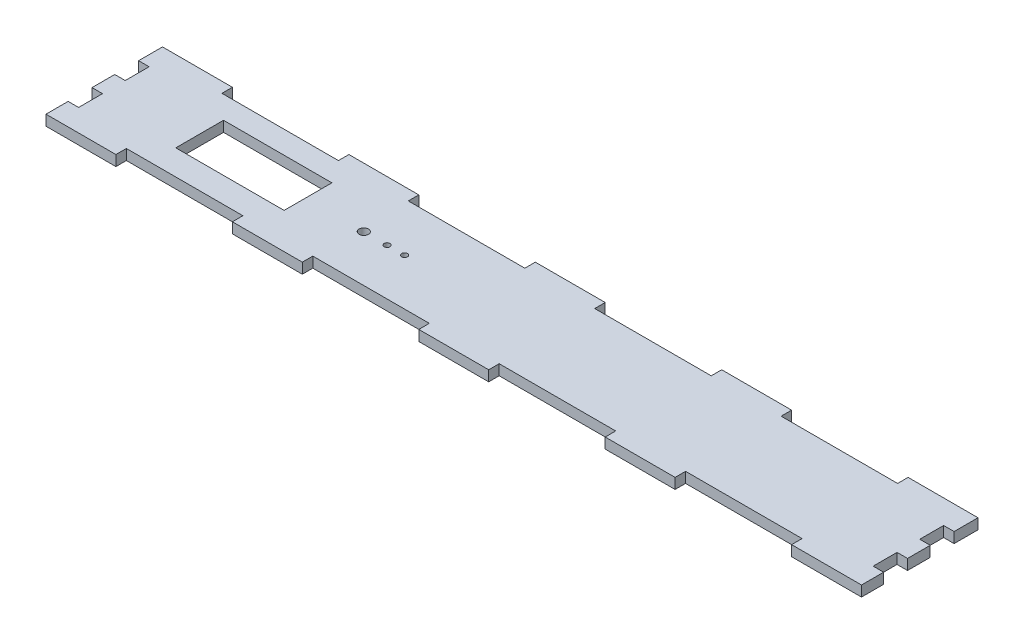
ISO-10303-21;
HEADER;
FILE_DESCRIPTION(('STEP AP214'),'2;1');
FILE_NAME('part.step','',(''),(''),'','','');
FILE_SCHEMA(('AUTOMOTIVE_DESIGN { 1 0 10303 214 1 1 1 1 }'));
ENDSEC;
DATA;
#1=APPLICATION_CONTEXT('core data for automotive mechanical design processes');
#2=APPLICATION_PROTOCOL_DEFINITION('international standard','automotive_design',2000,#1);
#3=PRODUCT_CONTEXT('',#1,'mechanical');
#4=PRODUCT('Part','Part','',(#3));
#5=PRODUCT_RELATED_PRODUCT_CATEGORY('part','',(#4));
#6=PRODUCT_DEFINITION_FORMATION('','',#4);
#7=PRODUCT_DEFINITION_CONTEXT('part definition',#1,'design');
#8=PRODUCT_DEFINITION('design','',#6,#7);
#9=PRODUCT_DEFINITION_SHAPE('','',#8);
#10=(LENGTH_UNIT() NAMED_UNIT(*) SI_UNIT(.MILLI.,.METRE.));
#11=(NAMED_UNIT(*) PLANE_ANGLE_UNIT() SI_UNIT($,.RADIAN.));
#12=(NAMED_UNIT(*) SI_UNIT($,.STERADIAN.) SOLID_ANGLE_UNIT());
#13=UNCERTAINTY_MEASURE_WITH_UNIT(LENGTH_MEASURE(1.E-05),#10,'distance_accuracy_value','');
#14=(GEOMETRIC_REPRESENTATION_CONTEXT(3) GLOBAL_UNCERTAINTY_ASSIGNED_CONTEXT((#13)) GLOBAL_UNIT_ASSIGNED_CONTEXT((#10,
#11,#12)) REPRESENTATION_CONTEXT('',''));
#15=CARTESIAN_POINT('',(0.,0.,0.));
#16=DIRECTION('',(0.,0.,1.));
#17=DIRECTION('',(1.,0.,0.));
#18=AXIS2_PLACEMENT_3D('',#15,#16,#17);
#19=CARTESIAN_POINT('',(-350.,9.,-50.));
#20=DIRECTION('',(0.,0.,1.));
#21=DIRECTION('',(1.,0.,0.));
#22=AXIS2_PLACEMENT_3D('',#19,#20,#21);
#23=PLANE('',#22);
#24=DIRECTION('',(-1.,0.,0.));
#25=VECTOR('',#24,1.);
#26=CARTESIAN_POINT('',(-350.,0.,-50.));
#27=LINE('',#26,#25);
#28=CARTESIAN_POINT('',(30.0000000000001,0.,-50.));
#29=VERTEX_POINT('',#28);
#30=CARTESIAN_POINT('',(-29.9999999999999,0.,-50.));
#31=VERTEX_POINT('',#30);
#32=EDGE_CURVE('E1107',#29,#31,#27,.T.);
#33=ORIENTED_EDGE('',*,*,#32,.T.);
#34=DIRECTION('',(0.,1.,0.));
#35=VECTOR('',#34,1.);
#36=CARTESIAN_POINT('',(-29.9999999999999,0.,-50.));
#37=LINE('',#36,#35);
#38=CARTESIAN_POINT('',(-29.9999999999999,9.,-50.));
#39=VERTEX_POINT('',#38);
#40=EDGE_CURVE('E579',#31,#39,#37,.T.);
#41=ORIENTED_EDGE('',*,*,#40,.T.);
#42=DIRECTION('',(-1.,0.,0.));
#43=VECTOR('',#42,1.);
#44=CARTESIAN_POINT('',(-350.,9.,-50.));
#45=LINE('',#44,#43);
#46=CARTESIAN_POINT('',(30.0000000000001,9.,-50.));
#47=VERTEX_POINT('',#46);
#48=EDGE_CURVE('E1080',#47,#39,#45,.T.);
#49=ORIENTED_EDGE('',*,*,#48,.F.);
#50=DIRECTION('',(0.,1.,0.));
#51=VECTOR('',#50,1.);
#52=CARTESIAN_POINT('',(30.0000000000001,0.,-50.));
#53=LINE('',#52,#51);
#54=EDGE_CURVE('E605',#29,#47,#53,.T.);
#55=ORIENTED_EDGE('',*,*,#54,.F.);
#56=EDGE_LOOP('',(#33,#41,#49,#55));
#57=FACE_BOUND('',#56,.T.);
#58=ADVANCED_FACE('F39',(#57),#23,.F.);
#59=CARTESIAN_POINT('',(190.,0.,-50.));
#60=VERTEX_POINT('',#59);
#61=CARTESIAN_POINT('',(130.,0.,-50.));
#62=VERTEX_POINT('',#61);
#63=EDGE_CURVE('E836',#60,#62,#27,.T.);
#64=ORIENTED_EDGE('',*,*,#63,.T.);
#65=DIRECTION('',(0.,1.,0.));
#66=VECTOR('',#65,1.);
#67=CARTESIAN_POINT('',(130.,0.,-50.));
#68=LINE('',#67,#66);
#69=CARTESIAN_POINT('',(130.,9.,-50.));
#70=VERTEX_POINT('',#69);
#71=EDGE_CURVE('E573',#62,#70,#68,.T.);
#72=ORIENTED_EDGE('',*,*,#71,.T.);
#73=CARTESIAN_POINT('',(190.,9.,-50.));
#74=VERTEX_POINT('',#73);
#75=EDGE_CURVE('E769',#74,#70,#45,.T.);
#76=ORIENTED_EDGE('',*,*,#75,.F.);
#77=DIRECTION('',(0.,1.,0.));
#78=VECTOR('',#77,1.);
#79=CARTESIAN_POINT('',(190.,0.,-50.));
#80=LINE('',#79,#78);
#81=EDGE_CURVE('E641',#60,#74,#80,.T.);
#82=ORIENTED_EDGE('',*,*,#81,.F.);
#83=EDGE_LOOP('',(#64,#72,#76,#82));
#84=FACE_BOUND('',#83,.T.);
#85=ADVANCED_FACE('F1039',(#84),#23,.F.);
#86=CARTESIAN_POINT('',(350.,0.,-50.));
#87=VERTEX_POINT('',#86);
#88=CARTESIAN_POINT('',(290.,0.,-50.));
#89=VERTEX_POINT('',#88);
#90=EDGE_CURVE('E831',#87,#89,#27,.T.);
#91=ORIENTED_EDGE('',*,*,#90,.T.);
#92=DIRECTION('',(0.,1.,0.));
#93=VECTOR('',#92,1.);
#94=CARTESIAN_POINT('',(290.,0.,-50.));
#95=LINE('',#94,#93);
#96=CARTESIAN_POINT('',(290.,9.,-50.));
#97=VERTEX_POINT('',#96);
#98=EDGE_CURVE('E611',#89,#97,#95,.T.);
#99=ORIENTED_EDGE('',*,*,#98,.T.);
#100=CARTESIAN_POINT('',(350.,9.,-50.));
#101=VERTEX_POINT('',#100);
#102=EDGE_CURVE('E764',#101,#97,#45,.T.);
#103=ORIENTED_EDGE('',*,*,#102,.F.);
#104=DIRECTION('',(0.,-1.,0.));
#105=VECTOR('',#104,1.);
#106=CARTESIAN_POINT('',(350.,9.,-50.));
#107=LINE('',#106,#105);
#108=EDGE_CURVE('E911',#101,#87,#107,.T.);
#109=ORIENTED_EDGE('',*,*,#108,.T.);
#110=EDGE_LOOP('',(#91,#99,#103,#109));
#111=FACE_BOUND('',#110,.T.);
#112=ADVANCED_FACE('F1046',(#111),#23,.F.);
#113=CARTESIAN_POINT('',(-290.,9.,-50.));
#114=VERTEX_POINT('',#113);
#115=CARTESIAN_POINT('',(-350.,9.,-50.));
#116=VERTEX_POINT('',#115);
#117=EDGE_CURVE('E763',#114,#116,#45,.T.);
#118=ORIENTED_EDGE('',*,*,#117,.F.);
#119=DIRECTION('',(0.,1.,0.));
#120=VECTOR('',#119,1.);
#121=CARTESIAN_POINT('',(-290.,0.,-50.));
#122=LINE('',#121,#120);
#123=CARTESIAN_POINT('',(-290.,0.,-50.));
#124=VERTEX_POINT('',#123);
#125=EDGE_CURVE('E721',#124,#114,#122,.T.);
#126=ORIENTED_EDGE('',*,*,#125,.F.);
#127=CARTESIAN_POINT('',(-350.,0.,-50.));
#128=VERTEX_POINT('',#127);
#129=EDGE_CURVE('E830',#124,#128,#27,.T.);
#130=ORIENTED_EDGE('',*,*,#129,.T.);
#131=DIRECTION('',(0.,-1.,0.));
#132=VECTOR('',#131,1.);
#133=CARTESIAN_POINT('',(-350.,9.,-50.));
#134=LINE('',#133,#132);
#135=EDGE_CURVE('E907',#116,#128,#134,.T.);
#136=ORIENTED_EDGE('',*,*,#135,.F.);
#137=EDGE_LOOP('',(#118,#126,#130,#136));
#138=FACE_BOUND('',#137,.T.);
#139=ADVANCED_FACE('F1035',(#138),#23,.F.);
#140=CARTESIAN_POINT('',(-350.,9.,50.));
#141=DIRECTION('',(0.,0.,-1.));
#142=DIRECTION('',(-1.,0.,0.));
#143=AXIS2_PLACEMENT_3D('',#140,#141,#142);
#144=PLANE('',#143);
#145=DIRECTION('',(1.,0.,0.));
#146=VECTOR('',#145,1.);
#147=CARTESIAN_POINT('',(-350.,0.,50.));
#148=LINE('',#147,#146);
#149=CARTESIAN_POINT('',(130.,0.,50.));
#150=VERTEX_POINT('',#149);
#151=CARTESIAN_POINT('',(190.,0.,50.));
#152=VERTEX_POINT('',#151);
#153=EDGE_CURVE('E973',#150,#152,#148,.T.);
#154=ORIENTED_EDGE('',*,*,#153,.T.);
#155=DIRECTION('',(0.,1.,0.));
#156=VECTOR('',#155,1.);
#157=CARTESIAN_POINT('',(190.,0.,50.));
#158=LINE('',#157,#156);
#159=CARTESIAN_POINT('',(190.,9.,50.));
#160=VERTEX_POINT('',#159);
#161=EDGE_CURVE('E677',#152,#160,#158,.T.);
#162=ORIENTED_EDGE('',*,*,#161,.T.);
#163=DIRECTION('',(1.,0.,0.));
#164=VECTOR('',#163,1.);
#165=CARTESIAN_POINT('',(-350.,9.,50.));
#166=LINE('',#165,#164);
#167=CARTESIAN_POINT('',(130.,9.,50.));
#168=VERTEX_POINT('',#167);
#169=EDGE_CURVE('E1005',#168,#160,#166,.T.);
#170=ORIENTED_EDGE('',*,*,#169,.F.);
#171=DIRECTION('',(0.,1.,0.));
#172=VECTOR('',#171,1.);
#173=CARTESIAN_POINT('',(130.,0.,50.));
#174=LINE('',#173,#172);
#175=EDGE_CURVE('E478',#150,#168,#174,.T.);
#176=ORIENTED_EDGE('',*,*,#175,.F.);
#177=EDGE_LOOP('',(#154,#162,#170,#176));
#178=FACE_BOUND('',#177,.T.);
#179=ADVANCED_FACE('F1021',(#178),#144,.F.);
#180=CARTESIAN_POINT('',(-29.9999999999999,0.,50.));
#181=VERTEX_POINT('',#180);
#182=CARTESIAN_POINT('',(30.0000000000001,0.,50.));
#183=VERTEX_POINT('',#182);
#184=EDGE_CURVE('E976',#181,#183,#148,.T.);
#185=ORIENTED_EDGE('',*,*,#184,.T.);
#186=DIRECTION('',(0.,1.,0.));
#187=VECTOR('',#186,1.);
#188=CARTESIAN_POINT('',(30.0000000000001,0.,50.));
#189=LINE('',#188,#187);
#190=CARTESIAN_POINT('',(30.0000000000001,9.,50.));
#191=VERTEX_POINT('',#190);
#192=EDGE_CURVE('E459',#183,#191,#189,.T.);
#193=ORIENTED_EDGE('',*,*,#192,.T.);
#194=CARTESIAN_POINT('',(-29.9999999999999,9.,50.));
#195=VERTEX_POINT('',#194);
#196=EDGE_CURVE('E1002',#195,#191,#166,.T.);
#197=ORIENTED_EDGE('',*,*,#196,.F.);
#198=DIRECTION('',(0.,1.,0.));
#199=VECTOR('',#198,1.);
#200=CARTESIAN_POINT('',(-29.9999999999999,0.,50.));
#201=LINE('',#200,#199);
#202=EDGE_CURVE('E514',#181,#195,#201,.T.);
#203=ORIENTED_EDGE('',*,*,#202,.F.);
#204=EDGE_LOOP('',(#185,#193,#197,#203));
#205=FACE_BOUND('',#204,.T.);
#206=ADVANCED_FACE('F1034',(#205),#144,.F.);
#207=CARTESIAN_POINT('',(-190.,0.,50.));
#208=VERTEX_POINT('',#207);
#209=CARTESIAN_POINT('',(-130.,0.,50.));
#210=VERTEX_POINT('',#209);
#211=EDGE_CURVE('E867',#208,#210,#148,.T.);
#212=ORIENTED_EDGE('',*,*,#211,.T.);
#213=DIRECTION('',(0.,1.,0.));
#214=VECTOR('',#213,1.);
#215=CARTESIAN_POINT('',(-130.,0.,50.));
#216=LINE('',#215,#214);
#217=CARTESIAN_POINT('',(-130.,9.,50.));
#218=VERTEX_POINT('',#217);
#219=EDGE_CURVE('E497',#210,#218,#216,.T.);
#220=ORIENTED_EDGE('',*,*,#219,.T.);
#221=CARTESIAN_POINT('',(-190.,9.,50.));
#222=VERTEX_POINT('',#221);
#223=EDGE_CURVE('E802',#222,#218,#166,.T.);
#224=ORIENTED_EDGE('',*,*,#223,.F.);
#225=DIRECTION('',(0.,1.,0.));
#226=VECTOR('',#225,1.);
#227=CARTESIAN_POINT('',(-190.,0.,50.));
#228=LINE('',#227,#226);
#229=EDGE_CURVE('E548',#208,#222,#228,.T.);
#230=ORIENTED_EDGE('',*,*,#229,.F.);
#231=EDGE_LOOP('',(#212,#220,#224,#230));
#232=FACE_BOUND('',#231,.T.);
#233=ADVANCED_FACE('F990',(#232),#144,.F.);
#234=CARTESIAN_POINT('',(-350.,0.,50.));
#235=VERTEX_POINT('',#234);
#236=CARTESIAN_POINT('',(-290.,0.,50.));
#237=VERTEX_POINT('',#236);
#238=EDGE_CURVE('E739',#235,#237,#148,.T.);
#239=ORIENTED_EDGE('',*,*,#238,.T.);
#240=DIRECTION('',(0.,1.,0.));
#241=VECTOR('',#240,1.);
#242=CARTESIAN_POINT('',(-290.,0.,50.));
#243=LINE('',#242,#241);
#244=CARTESIAN_POINT('',(-290.,9.,50.));
#245=VERTEX_POINT('',#244);
#246=EDGE_CURVE('E533',#237,#245,#243,.T.);
#247=ORIENTED_EDGE('',*,*,#246,.T.);
#248=CARTESIAN_POINT('',(-350.,9.,50.));
#249=VERTEX_POINT('',#248);
#250=EDGE_CURVE('E797',#249,#245,#166,.T.);
#251=ORIENTED_EDGE('',*,*,#250,.F.);
#252=DIRECTION('',(0.,-1.,0.));
#253=VECTOR('',#252,1.);
#254=CARTESIAN_POINT('',(-350.,9.,50.));
#255=LINE('',#254,#253);
#256=EDGE_CURVE('E871',#249,#235,#255,.T.);
#257=ORIENTED_EDGE('',*,*,#256,.T.);
#258=EDGE_LOOP('',(#239,#247,#251,#257));
#259=FACE_BOUND('',#258,.T.);
#260=ADVANCED_FACE('F1022',(#259),#144,.F.);
#261=CARTESIAN_POINT('',(349.999999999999,9.,31.));
#262=DIRECTION('',(-1.,0.,0.));
#263=DIRECTION('',(0.,0.,1.));
#264=AXIS2_PLACEMENT_3D('',#261,#262,#263);
#265=PLANE('',#264);
#266=DIRECTION('',(0.,0.,-1.));
#267=VECTOR('',#266,1.);
#268=CARTESIAN_POINT('',(349.999999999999,0.,31.));
#269=LINE('',#268,#267);
#270=CARTESIAN_POINT('',(350.,0.,50.));
#271=VERTEX_POINT('',#270);
#272=CARTESIAN_POINT('',(349.999999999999,0.,31.));
#273=VERTEX_POINT('',#272);
#274=EDGE_CURVE('E724',#271,#273,#269,.T.);
#275=ORIENTED_EDGE('',*,*,#274,.T.);
#276=DIRECTION('',(0.,-1.,0.));
#277=VECTOR('',#276,1.);
#278=CARTESIAN_POINT('',(349.999999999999,9.,31.));
#279=LINE('',#278,#277);
#280=CARTESIAN_POINT('',(349.999999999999,9.,31.));
#281=VERTEX_POINT('',#280);
#282=EDGE_CURVE('E11',#281,#273,#279,.T.);
#283=ORIENTED_EDGE('',*,*,#282,.F.);
#284=DIRECTION('',(0.,0.,-1.));
#285=VECTOR('',#284,1.);
#286=CARTESIAN_POINT('',(349.999999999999,9.,31.));
#287=LINE('',#286,#285);
#288=CARTESIAN_POINT('',(350.,9.,50.));
#289=VERTEX_POINT('',#288);
#290=EDGE_CURVE('E734',#289,#281,#287,.T.);
#291=ORIENTED_EDGE('',*,*,#290,.F.);
#292=DIRECTION('',(0.,-1.,0.));
#293=VECTOR('',#292,1.);
#294=CARTESIAN_POINT('',(350.,9.,50.));
#295=LINE('',#294,#293);
#296=EDGE_CURVE('E801',#289,#271,#295,.T.);
#297=ORIENTED_EDGE('',*,*,#296,.T.);
#298=EDGE_LOOP('',(#275,#283,#291,#297));
#299=FACE_BOUND('',#298,.T.);
#300=ADVANCED_FACE('F41',(#299),#265,.F.);
#301=CARTESIAN_POINT('',(349.999999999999,9.,31.));
#302=DIRECTION('',(0.,0.,1.));
#303=DIRECTION('',(1.,0.,0.));
#304=AXIS2_PLACEMENT_3D('',#301,#302,#303);
#305=PLANE('',#304);
#306=DIRECTION('',(-1.,0.,0.));
#307=VECTOR('',#306,1.);
#308=CARTESIAN_POINT('',(349.999999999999,0.,31.));
#309=LINE('',#308,#307);
#310=CARTESIAN_POINT('',(341.,0.,30.9999999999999));
#311=VERTEX_POINT('',#310);
#312=EDGE_CURVE('E806',#273,#311,#309,.T.);
#313=ORIENTED_EDGE('',*,*,#312,.T.);
#314=DIRECTION('',(0.,-1.,0.));
#315=VECTOR('',#314,1.);
#316=CARTESIAN_POINT('',(341.,9.,30.9999999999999));
#317=LINE('',#316,#315);
#318=CARTESIAN_POINT('',(341.,9.,30.9999999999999));
#319=VERTEX_POINT('',#318);
#320=EDGE_CURVE('E48',#319,#311,#317,.T.);
#321=ORIENTED_EDGE('',*,*,#320,.F.);
#322=DIRECTION('',(-1.,0.,0.));
#323=VECTOR('',#322,1.);
#324=CARTESIAN_POINT('',(349.999999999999,9.,31.));
#325=LINE('',#324,#323);
#326=EDGE_CURVE('E738',#281,#319,#325,.T.);
#327=ORIENTED_EDGE('',*,*,#326,.F.);
#328=ORIENTED_EDGE('',*,*,#282,.T.);
#329=EDGE_LOOP('',(#313,#321,#327,#328));
#330=FACE_BOUND('',#329,.T.);
#331=ADVANCED_FACE('F966',(#330),#305,.F.);
#332=CARTESIAN_POINT('',(341.,9.,10.4999999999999));
#333=DIRECTION('',(-1.,0.,0.));
#334=DIRECTION('',(0.,0.,1.));
#335=AXIS2_PLACEMENT_3D('',#332,#333,#334);
#336=PLANE('',#335);
#337=DIRECTION('',(0.,0.,-1.));
#338=VECTOR('',#337,1.);
#339=CARTESIAN_POINT('',(341.,0.,10.4999999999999));
#340=LINE('',#339,#338);
#341=CARTESIAN_POINT('',(341.,0.,10.4999999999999));
#342=VERTEX_POINT('',#341);
#343=EDGE_CURVE('E809',#311,#342,#340,.T.);
#344=ORIENTED_EDGE('',*,*,#343,.T.);
#345=DIRECTION('',(0.,-1.,0.));
#346=VECTOR('',#345,1.);
#347=CARTESIAN_POINT('',(341.,9.,10.4999999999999));
#348=LINE('',#347,#346);
#349=CARTESIAN_POINT('',(341.,9.,10.4999999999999));
#350=VERTEX_POINT('',#349);
#351=EDGE_CURVE('E935',#350,#342,#348,.T.);
#352=ORIENTED_EDGE('',*,*,#351,.F.);
#353=DIRECTION('',(0.,0.,-1.));
#354=VECTOR('',#353,1.);
#355=CARTESIAN_POINT('',(341.,9.,10.4999999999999));
#356=LINE('',#355,#354);
#357=EDGE_CURVE('E742',#319,#350,#356,.T.);
#358=ORIENTED_EDGE('',*,*,#357,.F.);
#359=ORIENTED_EDGE('',*,*,#320,.T.);
#360=EDGE_LOOP('',(#344,#352,#358,#359));
#361=FACE_BOUND('',#360,.T.);
#362=ADVANCED_FACE('F944',(#361),#336,.F.);
#363=CARTESIAN_POINT('',(349.999999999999,9.,10.5));
#364=DIRECTION('',(0.,0.,-1.));
#365=DIRECTION('',(-1.,0.,0.));
#366=AXIS2_PLACEMENT_3D('',#363,#364,#365);
#367=PLANE('',#366);
#368=DIRECTION('',(1.,0.,0.));
#369=VECTOR('',#368,1.);
#370=CARTESIAN_POINT('',(349.999999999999,0.,10.5));
#371=LINE('',#370,#369);
#372=CARTESIAN_POINT('',(349.999999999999,0.,10.5));
#373=VERTEX_POINT('',#372);
#374=EDGE_CURVE('E812',#342,#373,#371,.T.);
#375=ORIENTED_EDGE('',*,*,#374,.T.);
#376=DIRECTION('',(0.,-1.,0.));
#377=VECTOR('',#376,1.);
#378=CARTESIAN_POINT('',(349.999999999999,9.,10.5));
#379=LINE('',#378,#377);
#380=CARTESIAN_POINT('',(349.999999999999,9.,10.5));
#381=VERTEX_POINT('',#380);
#382=EDGE_CURVE('E931',#381,#373,#379,.T.);
#383=ORIENTED_EDGE('',*,*,#382,.F.);
#384=DIRECTION('',(1.,0.,0.));
#385=VECTOR('',#384,1.);
#386=CARTESIAN_POINT('',(349.999999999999,9.,10.5));
#387=LINE('',#386,#385);
#388=EDGE_CURVE('E745',#350,#381,#387,.T.);
#389=ORIENTED_EDGE('',*,*,#388,.F.);
#390=ORIENTED_EDGE('',*,*,#351,.T.);
#391=EDGE_LOOP('',(#375,#383,#389,#390));
#392=FACE_BOUND('',#391,.T.);
#393=ADVANCED_FACE('F953',(#392),#367,.F.);
#394=CARTESIAN_POINT('',(350.,9.,-9.00000000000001));
#395=DIRECTION('',(-1.,0.,0.));
#396=DIRECTION('',(0.,0.,1.));
#397=AXIS2_PLACEMENT_3D('',#394,#395,#396);
#398=PLANE('',#397);
#399=DIRECTION('',(0.,0.,-1.));
#400=VECTOR('',#399,1.);
#401=CARTESIAN_POINT('',(350.,0.,-9.00000000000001));
#402=LINE('',#401,#400);
#403=CARTESIAN_POINT('',(350.,0.,-9.00000000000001));
#404=VERTEX_POINT('',#403);
#405=EDGE_CURVE('E815',#373,#404,#402,.T.);
#406=ORIENTED_EDGE('',*,*,#405,.T.);
#407=DIRECTION('',(0.,-1.,0.));
#408=VECTOR('',#407,1.);
#409=CARTESIAN_POINT('',(350.,9.,-9.00000000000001));
#410=LINE('',#409,#408);
#411=CARTESIAN_POINT('',(350.,9.,-9.00000000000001));
#412=VERTEX_POINT('',#411);
#413=EDGE_CURVE('E927',#412,#404,#410,.T.);
#414=ORIENTED_EDGE('',*,*,#413,.F.);
#415=DIRECTION('',(0.,0.,-1.));
#416=VECTOR('',#415,1.);
#417=CARTESIAN_POINT('',(350.,9.,-9.00000000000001));
#418=LINE('',#417,#416);
#419=EDGE_CURVE('E748',#381,#412,#418,.T.);
#420=ORIENTED_EDGE('',*,*,#419,.F.);
#421=ORIENTED_EDGE('',*,*,#382,.T.);
#422=EDGE_LOOP('',(#406,#414,#420,#421));
#423=FACE_BOUND('',#422,.T.);
#424=ADVANCED_FACE('F957',(#423),#398,.F.);
#425=CARTESIAN_POINT('',(350.,9.,-9.00000000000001));
#426=DIRECTION('',(0.,0.,1.));
#427=DIRECTION('',(1.,0.,0.));
#428=AXIS2_PLACEMENT_3D('',#425,#426,#427);
#429=PLANE('',#428);
#430=DIRECTION('',(-1.,0.,0.));
#431=VECTOR('',#430,1.);
#432=CARTESIAN_POINT('',(350.,0.,-9.00000000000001));
#433=LINE('',#432,#431);
#434=CARTESIAN_POINT('',(341.,0.,-9.0000000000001));
#435=VERTEX_POINT('',#434);
#436=EDGE_CURVE('E818',#404,#435,#433,.T.);
#437=ORIENTED_EDGE('',*,*,#436,.T.);
#438=DIRECTION('',(0.,-1.,0.));
#439=VECTOR('',#438,1.);
#440=CARTESIAN_POINT('',(341.,9.,-9.0000000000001));
#441=LINE('',#440,#439);
#442=CARTESIAN_POINT('',(341.,9.,-9.0000000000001));
#443=VERTEX_POINT('',#442);
#444=EDGE_CURVE('E923',#443,#435,#441,.T.);
#445=ORIENTED_EDGE('',*,*,#444,.F.);
#446=DIRECTION('',(-1.,0.,0.));
#447=VECTOR('',#446,1.);
#448=CARTESIAN_POINT('',(350.,9.,-9.00000000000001));
#449=LINE('',#448,#447);
#450=EDGE_CURVE('E751',#412,#443,#449,.T.);
#451=ORIENTED_EDGE('',*,*,#450,.F.);
#452=ORIENTED_EDGE('',*,*,#413,.T.);
#453=EDGE_LOOP('',(#437,#445,#451,#452));
#454=FACE_BOUND('',#453,.T.);
#455=ADVANCED_FACE('F1575',(#454),#429,.F.);
#456=CARTESIAN_POINT('',(341.,9.,-29.5000000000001));
#457=DIRECTION('',(-1.,0.,0.));
#458=DIRECTION('',(0.,0.,1.));
#459=AXIS2_PLACEMENT_3D('',#456,#457,#458);
#460=PLANE('',#459);
#461=DIRECTION('',(0.,0.,-1.));
#462=VECTOR('',#461,1.);
#463=CARTESIAN_POINT('',(341.,0.,-29.5000000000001));
#464=LINE('',#463,#462);
#465=CARTESIAN_POINT('',(341.,0.,-29.5000000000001));
#466=VERTEX_POINT('',#465);
#467=EDGE_CURVE('E821',#435,#466,#464,.T.);
#468=ORIENTED_EDGE('',*,*,#467,.T.);
#469=DIRECTION('',(0.,-1.,0.));
#470=VECTOR('',#469,1.);
#471=CARTESIAN_POINT('',(341.,9.,-29.5000000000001));
#472=LINE('',#471,#470);
#473=CARTESIAN_POINT('',(341.,9.,-29.5000000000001));
#474=VERTEX_POINT('',#473);
#475=EDGE_CURVE('E919',#474,#466,#472,.T.);
#476=ORIENTED_EDGE('',*,*,#475,.F.);
#477=DIRECTION('',(0.,0.,-1.));
#478=VECTOR('',#477,1.);
#479=CARTESIAN_POINT('',(341.,9.,-29.5000000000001));
#480=LINE('',#479,#478);
#481=EDGE_CURVE('E754',#443,#474,#480,.T.);
#482=ORIENTED_EDGE('',*,*,#481,.F.);
#483=ORIENTED_EDGE('',*,*,#444,.T.);
#484=EDGE_LOOP('',(#468,#476,#482,#483));
#485=FACE_BOUND('',#484,.T.);
#486=ADVANCED_FACE('F1566',(#485),#460,.F.);
#487=CARTESIAN_POINT('',(350.,9.,-29.5));
#488=DIRECTION('',(0.,0.,-1.));
#489=DIRECTION('',(-1.,0.,0.));
#490=AXIS2_PLACEMENT_3D('',#487,#488,#489);
#491=PLANE('',#490);
#492=DIRECTION('',(1.,0.,0.));
#493=VECTOR('',#492,1.);
#494=CARTESIAN_POINT('',(350.,0.,-29.5));
#495=LINE('',#494,#493);
#496=CARTESIAN_POINT('',(350.,0.,-29.5));
#497=VERTEX_POINT('',#496);
#498=EDGE_CURVE('E824',#466,#497,#495,.T.);
#499=ORIENTED_EDGE('',*,*,#498,.T.);
#500=DIRECTION('',(0.,-1.,0.));
#501=VECTOR('',#500,1.);
#502=CARTESIAN_POINT('',(350.,9.,-29.5));
#503=LINE('',#502,#501);
#504=CARTESIAN_POINT('',(350.,9.,-29.5));
#505=VERTEX_POINT('',#504);
#506=EDGE_CURVE('E915',#505,#497,#503,.T.);
#507=ORIENTED_EDGE('',*,*,#506,.F.);
#508=DIRECTION('',(1.,0.,0.));
#509=VECTOR('',#508,1.);
#510=CARTESIAN_POINT('',(350.,9.,-29.5));
#511=LINE('',#510,#509);
#512=EDGE_CURVE('E757',#474,#505,#511,.T.);
#513=ORIENTED_EDGE('',*,*,#512,.F.);
#514=ORIENTED_EDGE('',*,*,#475,.T.);
#515=EDGE_LOOP('',(#499,#507,#513,#514));
#516=FACE_BOUND('',#515,.T.);
#517=ADVANCED_FACE('F1061',(#516),#491,.F.);
#518=CARTESIAN_POINT('',(350.,9.,-50.));
#519=DIRECTION('',(-1.,0.,0.));
#520=DIRECTION('',(0.,0.,1.));
#521=AXIS2_PLACEMENT_3D('',#518,#519,#520);
#522=PLANE('',#521);
#523=DIRECTION('',(0.,0.,-1.));
#524=VECTOR('',#523,1.);
#525=CARTESIAN_POINT('',(350.,0.,-50.));
#526=LINE('',#525,#524);
#527=EDGE_CURVE('E827',#497,#87,#526,.T.);
#528=ORIENTED_EDGE('',*,*,#527,.T.);
#529=ORIENTED_EDGE('',*,*,#108,.F.);
#530=DIRECTION('',(0.,0.,-1.));
#531=VECTOR('',#530,1.);
#532=CARTESIAN_POINT('',(350.,9.,-50.));
#533=LINE('',#532,#531);
#534=EDGE_CURVE('E760',#505,#101,#533,.T.);
#535=ORIENTED_EDGE('',*,*,#534,.F.);
#536=ORIENTED_EDGE('',*,*,#506,.T.);
#537=EDGE_LOOP('',(#528,#529,#535,#536));
#538=FACE_BOUND('',#537,.T.);
#539=ADVANCED_FACE('F1053',(#538),#522,.F.);
#540=CARTESIAN_POINT('',(-130.,9.,-50.));
#541=VERTEX_POINT('',#540);
#542=CARTESIAN_POINT('',(-190.,9.,-50.));
#543=VERTEX_POINT('',#542);
#544=EDGE_CURVE('E1077',#541,#543,#45,.T.);
#545=ORIENTED_EDGE('',*,*,#544,.F.);
#546=DIRECTION('',(0.,1.,0.));
#547=VECTOR('',#546,1.);
#548=CARTESIAN_POINT('',(-130.,0.,-50.));
#549=LINE('',#548,#547);
#550=CARTESIAN_POINT('',(-130.,0.,-50.));
#551=VERTEX_POINT('',#550);
#552=EDGE_CURVE('E567',#551,#541,#549,.T.);
#553=ORIENTED_EDGE('',*,*,#552,.F.);
#554=CARTESIAN_POINT('',(-190.,0.,-50.));
#555=VERTEX_POINT('',#554);
#556=EDGE_CURVE('E1120',#551,#555,#27,.T.);
#557=ORIENTED_EDGE('',*,*,#556,.T.);
#558=DIRECTION('',(0.,1.,0.));
#559=VECTOR('',#558,1.);
#560=CARTESIAN_POINT('',(-190.,0.,-50.));
#561=LINE('',#560,#559);
#562=EDGE_CURVE('E725',#555,#543,#561,.T.);
#563=ORIENTED_EDGE('',*,*,#562,.T.);
#564=EDGE_LOOP('',(#545,#553,#557,#563));
#565=FACE_BOUND('',#564,.T.);
#566=ADVANCED_FACE('F1042',(#565),#23,.F.);
#567=CARTESIAN_POINT('',(-350.,9.,-50.));
#568=DIRECTION('',(1.,0.,0.));
#569=DIRECTION('',(0.,0.,-1.));
#570=AXIS2_PLACEMENT_3D('',#567,#568,#569);
#571=PLANE('',#570);
#572=DIRECTION('',(0.,0.,1.));
#573=VECTOR('',#572,1.);
#574=CARTESIAN_POINT('',(-350.,0.,-50.));
#575=LINE('',#574,#573);
#576=CARTESIAN_POINT('',(-350.,0.,-29.5));
#577=VERTEX_POINT('',#576);
#578=EDGE_CURVE('E835',#128,#577,#575,.T.);
#579=ORIENTED_EDGE('',*,*,#578,.T.);
#580=DIRECTION('',(0.,-1.,0.));
#581=VECTOR('',#580,1.);
#582=CARTESIAN_POINT('',(-350.,9.,-29.5));
#583=LINE('',#582,#581);
#584=CARTESIAN_POINT('',(-350.,9.,-29.5));
#585=VERTEX_POINT('',#584);
#586=EDGE_CURVE('E903',#585,#577,#583,.T.);
#587=ORIENTED_EDGE('',*,*,#586,.F.);
#588=DIRECTION('',(0.,0.,1.));
#589=VECTOR('',#588,1.);
#590=CARTESIAN_POINT('',(-350.,9.,-50.));
#591=LINE('',#590,#589);
#592=EDGE_CURVE('E768',#116,#585,#591,.T.);
#593=ORIENTED_EDGE('',*,*,#592,.F.);
#594=ORIENTED_EDGE('',*,*,#135,.T.);
#595=EDGE_LOOP('',(#579,#587,#593,#594));
#596=FACE_BOUND('',#595,.T.);
#597=ADVANCED_FACE('F1052',(#596),#571,.F.);
#598=CARTESIAN_POINT('',(-350.,9.,-29.5));
#599=DIRECTION('',(0.,0.,-1.));
#600=DIRECTION('',(-1.,0.,0.));
#601=AXIS2_PLACEMENT_3D('',#598,#599,#600);
#602=PLANE('',#601);
#603=DIRECTION('',(1.,0.,0.));
#604=VECTOR('',#603,1.);
#605=CARTESIAN_POINT('',(-350.,0.,-29.5));
#606=LINE('',#605,#604);
#607=CARTESIAN_POINT('',(-341.,0.,-29.5));
#608=VERTEX_POINT('',#607);
#609=EDGE_CURVE('E839',#577,#608,#606,.T.);
#610=ORIENTED_EDGE('',*,*,#609,.T.);
#611=DIRECTION('',(0.,-1.,0.));
#612=VECTOR('',#611,1.);
#613=CARTESIAN_POINT('',(-341.,9.,-29.5));
#614=LINE('',#613,#612);
#615=CARTESIAN_POINT('',(-341.,9.,-29.5));
#616=VERTEX_POINT('',#615);
#617=EDGE_CURVE('E899',#616,#608,#614,.T.);
#618=ORIENTED_EDGE('',*,*,#617,.F.);
#619=DIRECTION('',(1.,0.,0.));
#620=VECTOR('',#619,1.);
#621=CARTESIAN_POINT('',(-350.,9.,-29.5));
#622=LINE('',#621,#620);
#623=EDGE_CURVE('E772',#585,#616,#622,.T.);
#624=ORIENTED_EDGE('',*,*,#623,.F.);
#625=ORIENTED_EDGE('',*,*,#586,.T.);
#626=EDGE_LOOP('',(#610,#618,#624,#625));
#627=FACE_BOUND('',#626,.T.);
#628=ADVANCED_FACE('F1059',(#627),#602,.F.);
#629=CARTESIAN_POINT('',(-341.,9.,-29.5));
#630=DIRECTION('',(1.,0.,0.));
#631=DIRECTION('',(0.,0.,-1.));
#632=AXIS2_PLACEMENT_3D('',#629,#630,#631);
#633=PLANE('',#632);
#634=DIRECTION('',(0.,0.,1.));
#635=VECTOR('',#634,1.);
#636=CARTESIAN_POINT('',(-341.,0.,-29.5));
#637=LINE('',#636,#635);
#638=CARTESIAN_POINT('',(-341.,0.,-9.00000000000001));
#639=VERTEX_POINT('',#638);
#640=EDGE_CURVE('E842',#608,#639,#637,.T.);
#641=ORIENTED_EDGE('',*,*,#640,.T.);
#642=DIRECTION('',(0.,-1.,0.));
#643=VECTOR('',#642,1.);
#644=CARTESIAN_POINT('',(-341.,9.,-9.00000000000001));
#645=LINE('',#644,#643);
#646=CARTESIAN_POINT('',(-341.,9.,-9.00000000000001));
#647=VERTEX_POINT('',#646);
#648=EDGE_CURVE('E895',#647,#639,#645,.T.);
#649=ORIENTED_EDGE('',*,*,#648,.F.);
#650=DIRECTION('',(0.,0.,1.));
#651=VECTOR('',#650,1.);
#652=CARTESIAN_POINT('',(-341.,9.,-29.5));
#653=LINE('',#652,#651);
#654=EDGE_CURVE('E775',#616,#647,#653,.T.);
#655=ORIENTED_EDGE('',*,*,#654,.F.);
#656=ORIENTED_EDGE('',*,*,#617,.T.);
#657=EDGE_LOOP('',(#641,#649,#655,#656));
#658=FACE_BOUND('',#657,.T.);
#659=ADVANCED_FACE('F1527',(#658),#633,.F.);
#660=CARTESIAN_POINT('',(-350.,9.,-9.00000000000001));
#661=DIRECTION('',(0.,0.,1.));
#662=DIRECTION('',(1.,0.,0.));
#663=AXIS2_PLACEMENT_3D('',#660,#661,#662);
#664=PLANE('',#663);
#665=DIRECTION('',(-1.,0.,0.));
#666=VECTOR('',#665,1.);
#667=CARTESIAN_POINT('',(-350.,0.,-9.00000000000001));
#668=LINE('',#667,#666);
#669=CARTESIAN_POINT('',(-350.,0.,-9.00000000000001));
#670=VERTEX_POINT('',#669);
#671=EDGE_CURVE('E845',#639,#670,#668,.T.);
#672=ORIENTED_EDGE('',*,*,#671,.T.);
#673=DIRECTION('',(0.,-1.,0.));
#674=VECTOR('',#673,1.);
#675=CARTESIAN_POINT('',(-350.,9.,-9.00000000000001));
#676=LINE('',#675,#674);
#677=CARTESIAN_POINT('',(-350.,9.,-9.00000000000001));
#678=VERTEX_POINT('',#677);
#679=EDGE_CURVE('E891',#678,#670,#676,.T.);
#680=ORIENTED_EDGE('',*,*,#679,.F.);
#681=DIRECTION('',(-1.,0.,0.));
#682=VECTOR('',#681,1.);
#683=CARTESIAN_POINT('',(-350.,9.,-9.00000000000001));
#684=LINE('',#683,#682);
#685=EDGE_CURVE('E778',#647,#678,#684,.T.);
#686=ORIENTED_EDGE('',*,*,#685,.F.);
#687=ORIENTED_EDGE('',*,*,#648,.T.);
#688=EDGE_LOOP('',(#672,#680,#686,#687));
#689=FACE_BOUND('',#688,.T.);
#690=ADVANCED_FACE('F1518',(#689),#664,.F.);
#691=CARTESIAN_POINT('',(-350.,9.,-9.00000000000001));
#692=DIRECTION('',(1.,0.,0.));
#693=DIRECTION('',(0.,0.,-1.));
#694=AXIS2_PLACEMENT_3D('',#691,#692,#693);
#695=PLANE('',#694);
#696=DIRECTION('',(0.,0.,1.));
#697=VECTOR('',#696,1.);
#698=CARTESIAN_POINT('',(-350.,0.,-9.00000000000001));
#699=LINE('',#698,#697);
#700=CARTESIAN_POINT('',(-349.999999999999,0.,10.5));
#701=VERTEX_POINT('',#700);
#702=EDGE_CURVE('E848',#670,#701,#699,.T.);
#703=ORIENTED_EDGE('',*,*,#702,.T.);
#704=DIRECTION('',(0.,-1.,0.));
#705=VECTOR('',#704,1.);
#706=CARTESIAN_POINT('',(-349.999999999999,9.,10.5));
#707=LINE('',#706,#705);
#708=CARTESIAN_POINT('',(-349.999999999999,9.,10.5));
#709=VERTEX_POINT('',#708);
#710=EDGE_CURVE('E887',#709,#701,#707,.T.);
#711=ORIENTED_EDGE('',*,*,#710,.F.);
#712=DIRECTION('',(0.,0.,1.));
#713=VECTOR('',#712,1.);
#714=CARTESIAN_POINT('',(-350.,9.,-9.00000000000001));
#715=LINE('',#714,#713);
#716=EDGE_CURVE('E781',#678,#709,#715,.T.);
#717=ORIENTED_EDGE('',*,*,#716,.F.);
#718=ORIENTED_EDGE('',*,*,#679,.T.);
#719=EDGE_LOOP('',(#703,#711,#717,#718));
#720=FACE_BOUND('',#719,.T.);
#721=ADVANCED_FACE('F1509',(#720),#695,.F.);
#722=CARTESIAN_POINT('',(-349.999999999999,9.,10.5));
#723=DIRECTION('',(0.,0.,-1.));
#724=DIRECTION('',(-1.,0.,0.));
#725=AXIS2_PLACEMENT_3D('',#722,#723,#724);
#726=PLANE('',#725);
#727=DIRECTION('',(1.,0.,0.));
#728=VECTOR('',#727,1.);
#729=CARTESIAN_POINT('',(-349.999999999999,0.,10.5));
#730=LINE('',#729,#728);
#731=CARTESIAN_POINT('',(-341.,0.,10.5));
#732=VERTEX_POINT('',#731);
#733=EDGE_CURVE('E851',#701,#732,#730,.T.);
#734=ORIENTED_EDGE('',*,*,#733,.T.);
#735=DIRECTION('',(0.,-1.,0.));
#736=VECTOR('',#735,1.);
#737=CARTESIAN_POINT('',(-341.,9.,10.5));
#738=LINE('',#737,#736);
#739=CARTESIAN_POINT('',(-341.,9.,10.5));
#740=VERTEX_POINT('',#739);
#741=EDGE_CURVE('E883',#740,#732,#738,.T.);
#742=ORIENTED_EDGE('',*,*,#741,.F.);
#743=DIRECTION('',(1.,0.,0.));
#744=VECTOR('',#743,1.);
#745=CARTESIAN_POINT('',(-349.999999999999,9.,10.5));
#746=LINE('',#745,#744);
#747=EDGE_CURVE('E784',#709,#740,#746,.T.);
#748=ORIENTED_EDGE('',*,*,#747,.F.);
#749=ORIENTED_EDGE('',*,*,#710,.T.);
#750=EDGE_LOOP('',(#734,#742,#748,#749));
#751=FACE_BOUND('',#750,.T.);
#752=ADVANCED_FACE('F1500',(#751),#726,.F.);
#753=CARTESIAN_POINT('',(-341.,9.,10.5));
#754=DIRECTION('',(1.,0.,0.));
#755=DIRECTION('',(0.,0.,-1.));
#756=AXIS2_PLACEMENT_3D('',#753,#754,#755);
#757=PLANE('',#756);
#758=DIRECTION('',(0.,0.,1.));
#759=VECTOR('',#758,1.);
#760=CARTESIAN_POINT('',(-341.,0.,10.5));
#761=LINE('',#760,#759);
#762=CARTESIAN_POINT('',(-341.,0.,31.));
#763=VERTEX_POINT('',#762);
#764=EDGE_CURVE('E854',#732,#763,#761,.T.);
#765=ORIENTED_EDGE('',*,*,#764,.T.);
#766=DIRECTION('',(0.,-1.,0.));
#767=VECTOR('',#766,1.);
#768=CARTESIAN_POINT('',(-341.,9.,31.));
#769=LINE('',#768,#767);
#770=CARTESIAN_POINT('',(-341.,9.,31.));
#771=VERTEX_POINT('',#770);
#772=EDGE_CURVE('E879',#771,#763,#769,.T.);
#773=ORIENTED_EDGE('',*,*,#772,.F.);
#774=DIRECTION('',(0.,0.,1.));
#775=VECTOR('',#774,1.);
#776=CARTESIAN_POINT('',(-341.,9.,10.5));
#777=LINE('',#776,#775);
#778=EDGE_CURVE('E787',#740,#771,#777,.T.);
#779=ORIENTED_EDGE('',*,*,#778,.F.);
#780=ORIENTED_EDGE('',*,*,#741,.T.);
#781=EDGE_LOOP('',(#765,#773,#779,#780));
#782=FACE_BOUND('',#781,.T.);
#783=ADVANCED_FACE('F1491',(#782),#757,.F.);
#784=CARTESIAN_POINT('',(-349.999999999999,9.,31.));
#785=DIRECTION('',(0.,0.,1.));
#786=DIRECTION('',(1.,0.,0.));
#787=AXIS2_PLACEMENT_3D('',#784,#785,#786);
#788=PLANE('',#787);
#789=DIRECTION('',(-1.,0.,0.));
#790=VECTOR('',#789,1.);
#791=CARTESIAN_POINT('',(-349.999999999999,0.,31.));
#792=LINE('',#791,#790);
#793=CARTESIAN_POINT('',(-349.999999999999,0.,31.));
#794=VERTEX_POINT('',#793);
#795=EDGE_CURVE('E857',#763,#794,#792,.T.);
#796=ORIENTED_EDGE('',*,*,#795,.T.);
#797=DIRECTION('',(0.,-1.,0.));
#798=VECTOR('',#797,1.);
#799=CARTESIAN_POINT('',(-349.999999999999,9.,31.));
#800=LINE('',#799,#798);
#801=CARTESIAN_POINT('',(-349.999999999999,9.,31.));
#802=VERTEX_POINT('',#801);
#803=EDGE_CURVE('E875',#802,#794,#800,.T.);
#804=ORIENTED_EDGE('',*,*,#803,.F.);
#805=DIRECTION('',(-1.,0.,0.));
#806=VECTOR('',#805,1.);
#807=CARTESIAN_POINT('',(-349.999999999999,9.,31.));
#808=LINE('',#807,#806);
#809=EDGE_CURVE('E790',#771,#802,#808,.T.);
#810=ORIENTED_EDGE('',*,*,#809,.F.);
#811=ORIENTED_EDGE('',*,*,#772,.T.);
#812=EDGE_LOOP('',(#796,#804,#810,#811));
#813=FACE_BOUND('',#812,.T.);
#814=ADVANCED_FACE('F1029',(#813),#788,.F.);
#815=CARTESIAN_POINT('',(-349.999999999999,9.,31.));
#816=DIRECTION('',(1.,0.,0.));
#817=DIRECTION('',(0.,0.,-1.));
#818=AXIS2_PLACEMENT_3D('',#815,#816,#817);
#819=PLANE('',#818);
#820=DIRECTION('',(0.,0.,1.));
#821=VECTOR('',#820,1.);
#822=CARTESIAN_POINT('',(-349.999999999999,0.,31.));
#823=LINE('',#822,#821);
#824=EDGE_CURVE('E860',#794,#235,#823,.T.);
#825=ORIENTED_EDGE('',*,*,#824,.T.);
#826=ORIENTED_EDGE('',*,*,#256,.F.);
#827=DIRECTION('',(0.,0.,1.));
#828=VECTOR('',#827,1.);
#829=CARTESIAN_POINT('',(-349.999999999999,9.,31.));
#830=LINE('',#829,#828);
#831=EDGE_CURVE('E793',#802,#249,#830,.T.);
#832=ORIENTED_EDGE('',*,*,#831,.F.);
#833=ORIENTED_EDGE('',*,*,#803,.T.);
#834=EDGE_LOOP('',(#825,#826,#832,#833));
#835=FACE_BOUND('',#834,.T.);
#836=ADVANCED_FACE('F1019',(#835),#819,.F.);
#837=CARTESIAN_POINT('',(290.,9.,50.));
#838=VERTEX_POINT('',#837);
#839=EDGE_CURVE('E796',#838,#289,#166,.T.);
#840=ORIENTED_EDGE('',*,*,#839,.F.);
#841=DIRECTION('',(0.,1.,0.));
#842=VECTOR('',#841,1.);
#843=CARTESIAN_POINT('',(290.,0.,50.));
#844=LINE('',#843,#842);
#845=CARTESIAN_POINT('',(290.,0.,50.));
#846=VERTEX_POINT('',#845);
#847=EDGE_CURVE('E692',#846,#838,#844,.T.);
#848=ORIENTED_EDGE('',*,*,#847,.F.);
#849=EDGE_CURVE('E863',#846,#271,#148,.T.);
#850=ORIENTED_EDGE('',*,*,#849,.T.);
#851=ORIENTED_EDGE('',*,*,#296,.F.);
#852=EDGE_LOOP('',(#840,#848,#850,#851));
#853=FACE_BOUND('',#852,.T.);
#854=ADVANCED_FACE('F1017',(#853),#144,.F.);
#855=CARTESIAN_POINT('',(0.,9.,0.));
#856=DIRECTION('',(0.,1.,0.));
#857=DIRECTION('',(0.,0.,1.));
#858=AXIS2_PLACEMENT_3D('',#855,#856,#857);
#859=PLANE('',#858);
#860=CARTESIAN_POINT('',(-126.265940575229,9.,0.957544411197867));
#861=DIRECTION('',(0.,1.,0.));
#862=DIRECTION('',(0.,0.,1.));
#863=AXIS2_PLACEMENT_3D('',#860,#861,#862);
#864=CIRCLE('',#863,4.00000000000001);
#865=CARTESIAN_POINT('',(-126.265940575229,9.,4.95754441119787));
#866=VERTEX_POINT('',#865);
#867=EDGE_CURVE('E1250',#866,#866,#864,.T.);
#868=ORIENTED_EDGE('',*,*,#867,.F.);
#869=EDGE_LOOP('',(#868));
#870=FACE_BOUND('',#869,.T.);
#871=CARTESIAN_POINT('',(-91.2659405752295,9.,0.957544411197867));
#872=DIRECTION('',(0.,1.,0.));
#873=DIRECTION('',(0.,0.,1.));
#874=AXIS2_PLACEMENT_3D('',#871,#872,#873);
#875=CIRCLE('',#874,2.5);
#876=CARTESIAN_POINT('',(-91.2659405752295,9.,3.45754441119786));
#877=VERTEX_POINT('',#876);
#878=EDGE_CURVE('E1241',#877,#877,#875,.T.);
#879=ORIENTED_EDGE('',*,*,#878,.F.);
#880=EDGE_LOOP('',(#879));
#881=FACE_BOUND('',#880,.T.);
#882=CARTESIAN_POINT('',(-106.265940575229,9.,0.957544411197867));
#883=DIRECTION('',(0.,1.,0.));
#884=DIRECTION('',(0.,0.,1.));
#885=AXIS2_PLACEMENT_3D('',#882,#883,#884);
#886=CIRCLE('',#885,2.49999999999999);
#887=CARTESIAN_POINT('',(-106.265940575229,9.,3.45754441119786));
#888=VERTEX_POINT('',#887);
#889=EDGE_CURVE('E421',#888,#888,#886,.T.);
#890=ORIENTED_EDGE('',*,*,#889,.F.);
#891=EDGE_LOOP('',(#890));
#892=FACE_BOUND('',#891,.T.);
#893=DIRECTION('',(0.,0.,-1.));
#894=VECTOR('',#893,1.);
#895=CARTESIAN_POINT('',(-176.26594057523,9.,-21.6601887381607));
#896=LINE('',#895,#894);
#897=CARTESIAN_POINT('',(-176.26594057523,9.,19.3398112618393));
#898=VERTEX_POINT('',#897);
#899=CARTESIAN_POINT('',(-176.26594057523,9.,-21.6601887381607));
#900=VERTEX_POINT('',#899);
#901=EDGE_CURVE('E55',#898,#900,#896,.T.);
#902=ORIENTED_EDGE('',*,*,#901,.F.);
#903=DIRECTION('',(1.,0.,0.));
#904=VECTOR('',#903,1.);
#905=CARTESIAN_POINT('',(-269.26594057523,9.,19.3398112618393));
#906=LINE('',#905,#904);
#907=CARTESIAN_POINT('',(-269.26594057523,9.,19.3398112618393));
#908=VERTEX_POINT('',#907);
#909=EDGE_CURVE('E414',#908,#898,#906,.T.);
#910=ORIENTED_EDGE('',*,*,#909,.F.);
#911=DIRECTION('',(0.,0.,1.));
#912=VECTOR('',#911,1.);
#913=CARTESIAN_POINT('',(-269.26594057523,9.,-21.6601887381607));
#914=LINE('',#913,#912);
#915=CARTESIAN_POINT('',(-269.26594057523,9.,-21.6601887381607));
#916=VERTEX_POINT('',#915);
#917=EDGE_CURVE('E418',#916,#908,#914,.T.);
#918=ORIENTED_EDGE('',*,*,#917,.F.);
#919=DIRECTION('',(-1.,0.,0.));
#920=VECTOR('',#919,1.);
#921=CARTESIAN_POINT('',(-269.26594057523,9.,-21.6601887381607));
#922=LINE('',#921,#920);
#923=EDGE_CURVE('E430',#900,#916,#922,.T.);
#924=ORIENTED_EDGE('',*,*,#923,.F.);
#925=EDGE_LOOP('',(#902,#910,#918,#924));
#926=FACE_BOUND('',#925,.T.);
#927=DIRECTION('',(0.,0.,-1.));
#928=VECTOR('',#927,1.);
#929=CARTESIAN_POINT('',(-29.9999999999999,9.,-50.));
#930=LINE('',#929,#928);
#931=CARTESIAN_POINT('',(-29.9999999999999,9.,-41.));
#932=VERTEX_POINT('',#931);
#933=EDGE_CURVE('E559',#932,#39,#930,.T.);
#934=ORIENTED_EDGE('',*,*,#933,.F.);
#935=DIRECTION('',(1.,0.,0.));
#936=VECTOR('',#935,1.);
#937=CARTESIAN_POINT('',(-130.,9.,-41.));
#938=LINE('',#937,#936);
#939=CARTESIAN_POINT('',(-130.,9.,-41.));
#940=VERTEX_POINT('',#939);
#941=EDGE_CURVE('E572',#940,#932,#938,.T.);
#942=ORIENTED_EDGE('',*,*,#941,.F.);
#943=DIRECTION('',(0.,0.,1.));
#944=VECTOR('',#943,1.);
#945=CARTESIAN_POINT('',(-130.,9.,-50.));
#946=LINE('',#945,#944);
#947=EDGE_CURVE('E568',#541,#940,#946,.T.);
#948=ORIENTED_EDGE('',*,*,#947,.F.);
#949=ORIENTED_EDGE('',*,*,#544,.T.);
#950=DIRECTION('',(0.,0.,-1.));
#951=VECTOR('',#950,1.);
#952=CARTESIAN_POINT('',(-190.,9.,-50.));
#953=LINE('',#952,#951);
#954=CARTESIAN_POINT('',(-190.,9.,-41.));
#955=VERTEX_POINT('',#954);
#956=EDGE_CURVE('E703',#955,#543,#953,.T.);
#957=ORIENTED_EDGE('',*,*,#956,.F.);
#958=DIRECTION('',(1.,0.,0.));
#959=VECTOR('',#958,1.);
#960=CARTESIAN_POINT('',(-290.,9.,-41.));
#961=LINE('',#960,#959);
#962=CARTESIAN_POINT('',(-290.,9.,-41.));
#963=VERTEX_POINT('',#962);
#964=EDGE_CURVE('E715',#963,#955,#961,.T.);
#965=ORIENTED_EDGE('',*,*,#964,.F.);
#966=DIRECTION('',(0.,0.,1.));
#967=VECTOR('',#966,1.);
#968=CARTESIAN_POINT('',(-290.,9.,-50.));
#969=LINE('',#968,#967);
#970=EDGE_CURVE('E583',#114,#963,#969,.T.);
#971=ORIENTED_EDGE('',*,*,#970,.F.);
#972=ORIENTED_EDGE('',*,*,#117,.T.);
#973=ORIENTED_EDGE('',*,*,#592,.T.);
#974=ORIENTED_EDGE('',*,*,#623,.T.);
#975=ORIENTED_EDGE('',*,*,#654,.T.);
#976=ORIENTED_EDGE('',*,*,#685,.T.);
#977=ORIENTED_EDGE('',*,*,#716,.T.);
#978=ORIENTED_EDGE('',*,*,#747,.T.);
#979=ORIENTED_EDGE('',*,*,#778,.T.);
#980=ORIENTED_EDGE('',*,*,#809,.T.);
#981=ORIENTED_EDGE('',*,*,#831,.T.);
#982=ORIENTED_EDGE('',*,*,#250,.T.);
#983=DIRECTION('',(0.,0.,1.));
#984=VECTOR('',#983,1.);
#985=CARTESIAN_POINT('',(-290.,9.,50.));
#986=LINE('',#985,#984);
#987=CARTESIAN_POINT('',(-290.,9.,41.));
#988=VERTEX_POINT('',#987);
#989=EDGE_CURVE('E440',#988,#245,#986,.T.);
#990=ORIENTED_EDGE('',*,*,#989,.F.);
#991=DIRECTION('',(-1.,0.,0.));
#992=VECTOR('',#991,1.);
#993=CARTESIAN_POINT('',(-290.,9.,41.));
#994=LINE('',#993,#992);
#995=CARTESIAN_POINT('',(-190.,9.,41.));
#996=VERTEX_POINT('',#995);
#997=EDGE_CURVE('E525',#996,#988,#994,.T.);
#998=ORIENTED_EDGE('',*,*,#997,.F.);
#999=DIRECTION('',(0.,0.,-1.));
#1000=VECTOR('',#999,1.);
#1001=CARTESIAN_POINT('',(-190.,9.,50.));
#1002=LINE('',#1001,#1000);
#1003=EDGE_CURVE('E536',#222,#996,#1002,.T.);
#1004=ORIENTED_EDGE('',*,*,#1003,.F.);
#1005=ORIENTED_EDGE('',*,*,#223,.T.);
#1006=DIRECTION('',(0.,0.,1.));
#1007=VECTOR('',#1006,1.);
#1008=CARTESIAN_POINT('',(-130.,9.,50.));
#1009=LINE('',#1008,#1007);
#1010=CARTESIAN_POINT('',(-130.,9.,41.));
#1011=VERTEX_POINT('',#1010);
#1012=EDGE_CURVE('E498',#1011,#218,#1009,.T.);
#1013=ORIENTED_EDGE('',*,*,#1012,.F.);
#1014=DIRECTION('',(-1.,0.,0.));
#1015=VECTOR('',#1014,1.);
#1016=CARTESIAN_POINT('',(-130.,9.,41.));
#1017=LINE('',#1016,#1015);
#1018=CARTESIAN_POINT('',(-29.9999999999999,9.,41.));
#1019=VERTEX_POINT('',#1018);
#1020=EDGE_CURVE('E489',#1019,#1011,#1017,.T.);
#1021=ORIENTED_EDGE('',*,*,#1020,.F.);
#1022=DIRECTION('',(0.,0.,-1.));
#1023=VECTOR('',#1022,1.);
#1024=CARTESIAN_POINT('',(-29.9999999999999,9.,50.));
#1025=LINE('',#1024,#1023);
#1026=EDGE_CURVE('E501',#195,#1019,#1025,.T.);
#1027=ORIENTED_EDGE('',*,*,#1026,.F.);
#1028=ORIENTED_EDGE('',*,*,#196,.T.);
#1029=DIRECTION('',(0.,0.,1.));
#1030=VECTOR('',#1029,1.);
#1031=CARTESIAN_POINT('',(30.0000000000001,9.,50.));
#1032=LINE('',#1031,#1030);
#1033=CARTESIAN_POINT('',(30.,9.,41.));
#1034=VERTEX_POINT('',#1033);
#1035=EDGE_CURVE('E460',#1034,#191,#1032,.T.);
#1036=ORIENTED_EDGE('',*,*,#1035,.F.);
#1037=DIRECTION('',(-1.,0.,0.));
#1038=VECTOR('',#1037,1.);
#1039=CARTESIAN_POINT('',(30.,9.,41.));
#1040=LINE('',#1039,#1038);
#1041=CARTESIAN_POINT('',(130.,9.,41.));
#1042=VERTEX_POINT('',#1041);
#1043=EDGE_CURVE('E451',#1042,#1034,#1040,.T.);
#1044=ORIENTED_EDGE('',*,*,#1043,.F.);
#1045=DIRECTION('',(0.,0.,-1.));
#1046=VECTOR('',#1045,1.);
#1047=CARTESIAN_POINT('',(130.,9.,50.));
#1048=LINE('',#1047,#1046);
#1049=EDGE_CURVE('E463',#168,#1042,#1048,.T.);
#1050=ORIENTED_EDGE('',*,*,#1049,.F.);
#1051=ORIENTED_EDGE('',*,*,#169,.T.);
#1052=DIRECTION('',(0.,0.,1.));
#1053=VECTOR('',#1052,1.);
#1054=CARTESIAN_POINT('',(190.,9.,50.));
#1055=LINE('',#1054,#1053);
#1056=CARTESIAN_POINT('',(190.,9.,41.));
#1057=VERTEX_POINT('',#1056);
#1058=EDGE_CURVE('E474',#1057,#160,#1055,.T.);
#1059=ORIENTED_EDGE('',*,*,#1058,.F.);
#1060=DIRECTION('',(-1.,0.,0.));
#1061=VECTOR('',#1060,1.);
#1062=CARTESIAN_POINT('',(190.,9.,41.));
#1063=LINE('',#1062,#1061);
#1064=CARTESIAN_POINT('',(290.,9.,41.));
#1065=VERTEX_POINT('',#1064);
#1066=EDGE_CURVE('E669',#1065,#1057,#1063,.T.);
#1067=ORIENTED_EDGE('',*,*,#1066,.F.);
#1068=DIRECTION('',(0.,0.,-1.));
#1069=VECTOR('',#1068,1.);
#1070=CARTESIAN_POINT('',(290.,9.,50.));
#1071=LINE('',#1070,#1069);
#1072=EDGE_CURVE('E680',#838,#1065,#1071,.T.);
#1073=ORIENTED_EDGE('',*,*,#1072,.F.);
#1074=ORIENTED_EDGE('',*,*,#839,.T.);
#1075=ORIENTED_EDGE('',*,*,#290,.T.);
#1076=ORIENTED_EDGE('',*,*,#326,.T.);
#1077=ORIENTED_EDGE('',*,*,#357,.T.);
#1078=ORIENTED_EDGE('',*,*,#388,.T.);
#1079=ORIENTED_EDGE('',*,*,#419,.T.);
#1080=ORIENTED_EDGE('',*,*,#450,.T.);
#1081=ORIENTED_EDGE('',*,*,#481,.T.);
#1082=ORIENTED_EDGE('',*,*,#512,.T.);
#1083=ORIENTED_EDGE('',*,*,#534,.T.);
#1084=ORIENTED_EDGE('',*,*,#102,.T.);
#1085=DIRECTION('',(0.,0.,-1.));
#1086=VECTOR('',#1085,1.);
#1087=CARTESIAN_POINT('',(290.,9.,-50.));
#1088=LINE('',#1087,#1086);
#1089=CARTESIAN_POINT('',(290.,9.,-41.));
#1090=VERTEX_POINT('',#1089);
#1091=EDGE_CURVE('E633',#1090,#97,#1088,.T.);
#1092=ORIENTED_EDGE('',*,*,#1091,.F.);
#1093=DIRECTION('',(1.,0.,0.));
#1094=VECTOR('',#1093,1.);
#1095=CARTESIAN_POINT('',(190.,9.,-41.));
#1096=LINE('',#1095,#1094);
#1097=CARTESIAN_POINT('',(190.,9.,-41.));
#1098=VERTEX_POINT('',#1097);
#1099=EDGE_CURVE('E646',#1098,#1090,#1096,.T.);
#1100=ORIENTED_EDGE('',*,*,#1099,.F.);
#1101=DIRECTION('',(0.,0.,1.));
#1102=VECTOR('',#1101,1.);
#1103=CARTESIAN_POINT('',(190.,9.,-50.));
#1104=LINE('',#1103,#1102);
#1105=EDGE_CURVE('E642',#74,#1098,#1104,.T.);
#1106=ORIENTED_EDGE('',*,*,#1105,.F.);
#1107=ORIENTED_EDGE('',*,*,#75,.T.);
#1108=DIRECTION('',(0.,0.,-1.));
#1109=VECTOR('',#1108,1.);
#1110=CARTESIAN_POINT('',(130.,9.,-50.));
#1111=LINE('',#1110,#1109);
#1112=CARTESIAN_POINT('',(130.,9.,-41.));
#1113=VERTEX_POINT('',#1112);
#1114=EDGE_CURVE('E597',#1113,#70,#1111,.T.);
#1115=ORIENTED_EDGE('',*,*,#1114,.F.);
#1116=DIRECTION('',(1.,0.,0.));
#1117=VECTOR('',#1116,1.);
#1118=CARTESIAN_POINT('',(30.,9.,-41.));
#1119=LINE('',#1118,#1117);
#1120=CARTESIAN_POINT('',(30.,9.,-41.));
#1121=VERTEX_POINT('',#1120);
#1122=EDGE_CURVE('E610',#1121,#1113,#1119,.T.);
#1123=ORIENTED_EDGE('',*,*,#1122,.F.);
#1124=DIRECTION('',(0.,0.,1.));
#1125=VECTOR('',#1124,1.);
#1126=CARTESIAN_POINT('',(30.0000000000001,9.,-50.));
#1127=LINE('',#1126,#1125);
#1128=EDGE_CURVE('E606',#47,#1121,#1127,.T.);
#1129=ORIENTED_EDGE('',*,*,#1128,.F.);
#1130=ORIENTED_EDGE('',*,*,#48,.T.);
#1131=EDGE_LOOP('',(#934,#942,#948,#949,#957,#965,#971,#972,#973,#974,#975,#976,#977,#978,#979,
#980,#981,#982,#990,#998,#1004,#1005,#1013,#1021,#1027,#1028,#1036,#1044,#1050,#1051,#1059,
#1067,#1073,#1074,#1075,#1076,#1077,#1078,#1079,#1080,#1081,#1082,#1083,#1084,#1092,#1100,#1106,
#1107,#1115,#1123,#1129,#1130));
#1132=FACE_BOUND('',#1131,.T.);
#1133=ADVANCED_FACE('F962',(#870,#881,#892,#926,#1132),#859,.T.);
#1134=CARTESIAN_POINT('',(0.,0.,0.));
#1135=DIRECTION('',(0.,1.,0.));
#1136=DIRECTION('',(0.,0.,1.));
#1137=AXIS2_PLACEMENT_3D('',#1134,#1135,#1136);
#1138=PLANE('',#1137);
#1139=CARTESIAN_POINT('',(-126.265940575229,0.,0.957544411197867));
#1140=DIRECTION('',(0.,1.,0.));
#1141=DIRECTION('',(0.,0.,1.));
#1142=AXIS2_PLACEMENT_3D('',#1139,#1140,#1141);
#1143=CIRCLE('',#1142,4.00000000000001);
#1144=CARTESIAN_POINT('',(-126.265940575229,0.,4.95754441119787));
#1145=VERTEX_POINT('',#1144);
#1146=EDGE_CURVE('E1244',#1145,#1145,#1143,.T.);
#1147=ORIENTED_EDGE('',*,*,#1146,.T.);
#1148=EDGE_LOOP('',(#1147));
#1149=FACE_BOUND('',#1148,.T.);
#1150=CARTESIAN_POINT('',(-91.2659405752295,0.,0.957544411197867));
#1151=DIRECTION('',(0.,1.,0.));
#1152=DIRECTION('',(0.,0.,1.));
#1153=AXIS2_PLACEMENT_3D('',#1150,#1151,#1152);
#1154=CIRCLE('',#1153,2.5);
#1155=CARTESIAN_POINT('',(-91.2659405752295,0.,3.45754441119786));
#1156=VERTEX_POINT('',#1155);
#1157=EDGE_CURVE('E1238',#1156,#1156,#1154,.T.);
#1158=ORIENTED_EDGE('',*,*,#1157,.T.);
#1159=EDGE_LOOP('',(#1158));
#1160=FACE_BOUND('',#1159,.T.);
#1161=CARTESIAN_POINT('',(-106.265940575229,0.,0.957544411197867));
#1162=DIRECTION('',(0.,1.,0.));
#1163=DIRECTION('',(0.,0.,1.));
#1164=AXIS2_PLACEMENT_3D('',#1161,#1162,#1163);
#1165=CIRCLE('',#1164,2.49999999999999);
#1166=CARTESIAN_POINT('',(-106.265940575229,0.,3.45754441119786));
#1167=VERTEX_POINT('',#1166);
#1168=EDGE_CURVE('E431',#1167,#1167,#1165,.T.);
#1169=ORIENTED_EDGE('',*,*,#1168,.T.);
#1170=EDGE_LOOP('',(#1169));
#1171=FACE_BOUND('',#1170,.T.);
#1172=DIRECTION('',(1.,0.,0.));
#1173=VECTOR('',#1172,1.);
#1174=CARTESIAN_POINT('',(-269.26594057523,0.,19.3398112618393));
#1175=LINE('',#1174,#1173);
#1176=CARTESIAN_POINT('',(-269.26594057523,0.,19.3398112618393));
#1177=VERTEX_POINT('',#1176);
#1178=CARTESIAN_POINT('',(-176.26594057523,0.,19.3398112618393));
#1179=VERTEX_POINT('',#1178);
#1180=EDGE_CURVE('E402',#1177,#1179,#1175,.T.);
#1181=ORIENTED_EDGE('',*,*,#1180,.T.);
#1182=DIRECTION('',(0.,0.,-1.));
#1183=VECTOR('',#1182,1.);
#1184=CARTESIAN_POINT('',(-176.26594057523,0.,-21.6601887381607));
#1185=LINE('',#1184,#1183);
#1186=CARTESIAN_POINT('',(-176.26594057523,0.,-21.6601887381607));
#1187=VERTEX_POINT('',#1186);
#1188=EDGE_CURVE('E395',#1179,#1187,#1185,.T.);
#1189=ORIENTED_EDGE('',*,*,#1188,.T.);
#1190=DIRECTION('',(-1.,0.,0.));
#1191=VECTOR('',#1190,1.);
#1192=CARTESIAN_POINT('',(-269.26594057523,0.,-21.6601887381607));
#1193=LINE('',#1192,#1191);
#1194=CARTESIAN_POINT('',(-269.26594057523,0.,-21.6601887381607));
#1195=VERTEX_POINT('',#1194);
#1196=EDGE_CURVE('E405',#1187,#1195,#1193,.T.);
#1197=ORIENTED_EDGE('',*,*,#1196,.T.);
#1198=DIRECTION('',(0.,0.,1.));
#1199=VECTOR('',#1198,1.);
#1200=CARTESIAN_POINT('',(-269.26594057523,0.,-21.6601887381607));
#1201=LINE('',#1200,#1199);
#1202=EDGE_CURVE('E63',#1195,#1177,#1201,.T.);
#1203=ORIENTED_EDGE('',*,*,#1202,.T.);
#1204=EDGE_LOOP('',(#1181,#1189,#1197,#1203));
#1205=FACE_BOUND('',#1204,.T.);
#1206=DIRECTION('',(1.,0.,0.));
#1207=VECTOR('',#1206,1.);
#1208=CARTESIAN_POINT('',(-130.,0.,-41.));
#1209=LINE('',#1208,#1207);
#1210=CARTESIAN_POINT('',(-130.,0.,-41.));
#1211=VERTEX_POINT('',#1210);
#1212=CARTESIAN_POINT('',(-29.9999999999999,0.,-41.));
#1213=VERTEX_POINT('',#1212);
#1214=EDGE_CURVE('E558',#1211,#1213,#1209,.T.);
#1215=ORIENTED_EDGE('',*,*,#1214,.T.);
#1216=DIRECTION('',(0.,0.,-1.));
#1217=VECTOR('',#1216,1.);
#1218=CARTESIAN_POINT('',(-29.9999999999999,0.,-50.));
#1219=LINE('',#1218,#1217);
#1220=EDGE_CURVE('E563',#1213,#31,#1219,.T.);
#1221=ORIENTED_EDGE('',*,*,#1220,.T.);
#1222=ORIENTED_EDGE('',*,*,#32,.F.);
#1223=DIRECTION('',(0.,0.,1.));
#1224=VECTOR('',#1223,1.);
#1225=CARTESIAN_POINT('',(30.0000000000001,0.,-50.));
#1226=LINE('',#1225,#1224);
#1227=CARTESIAN_POINT('',(30.,0.,-41.));
#1228=VERTEX_POINT('',#1227);
#1229=EDGE_CURVE('E592',#29,#1228,#1226,.T.);
#1230=ORIENTED_EDGE('',*,*,#1229,.T.);
#1231=DIRECTION('',(1.,0.,0.));
#1232=VECTOR('',#1231,1.);
#1233=CARTESIAN_POINT('',(30.,0.,-41.));
#1234=LINE('',#1233,#1232);
#1235=CARTESIAN_POINT('',(130.,0.,-41.));
#1236=VERTEX_POINT('',#1235);
#1237=EDGE_CURVE('E596',#1228,#1236,#1234,.T.);
#1238=ORIENTED_EDGE('',*,*,#1237,.T.);
#1239=DIRECTION('',(0.,0.,-1.));
#1240=VECTOR('',#1239,1.);
#1241=CARTESIAN_POINT('',(130.,0.,-50.));
#1242=LINE('',#1241,#1240);
#1243=EDGE_CURVE('E601',#1236,#62,#1242,.T.);
#1244=ORIENTED_EDGE('',*,*,#1243,.T.);
#1245=ORIENTED_EDGE('',*,*,#63,.F.);
#1246=DIRECTION('',(0.,0.,1.));
#1247=VECTOR('',#1246,1.);
#1248=CARTESIAN_POINT('',(190.,0.,-50.));
#1249=LINE('',#1248,#1247);
#1250=CARTESIAN_POINT('',(190.,0.,-41.));
#1251=VERTEX_POINT('',#1250);
#1252=EDGE_CURVE('E628',#60,#1251,#1249,.T.);
#1253=ORIENTED_EDGE('',*,*,#1252,.T.);
#1254=DIRECTION('',(1.,0.,0.));
#1255=VECTOR('',#1254,1.);
#1256=CARTESIAN_POINT('',(190.,0.,-41.));
#1257=LINE('',#1256,#1255);
#1258=CARTESIAN_POINT('',(290.,0.,-41.));
#1259=VERTEX_POINT('',#1258);
#1260=EDGE_CURVE('E632',#1251,#1259,#1257,.T.);
#1261=ORIENTED_EDGE('',*,*,#1260,.T.);
#1262=DIRECTION('',(0.,0.,-1.));
#1263=VECTOR('',#1262,1.);
#1264=CARTESIAN_POINT('',(290.,0.,-50.));
#1265=LINE('',#1264,#1263);
#1266=EDGE_CURVE('E637',#1259,#89,#1265,.T.);
#1267=ORIENTED_EDGE('',*,*,#1266,.T.);
#1268=ORIENTED_EDGE('',*,*,#90,.F.);
#1269=ORIENTED_EDGE('',*,*,#527,.F.);
#1270=ORIENTED_EDGE('',*,*,#498,.F.);
#1271=ORIENTED_EDGE('',*,*,#467,.F.);
#1272=ORIENTED_EDGE('',*,*,#436,.F.);
#1273=ORIENTED_EDGE('',*,*,#405,.F.);
#1274=ORIENTED_EDGE('',*,*,#374,.F.);
#1275=ORIENTED_EDGE('',*,*,#343,.F.);
#1276=ORIENTED_EDGE('',*,*,#312,.F.);
#1277=ORIENTED_EDGE('',*,*,#274,.F.);
#1278=ORIENTED_EDGE('',*,*,#849,.F.);
#1279=DIRECTION('',(0.,0.,-1.));
#1280=VECTOR('',#1279,1.);
#1281=CARTESIAN_POINT('',(290.,0.,50.));
#1282=LINE('',#1281,#1280);
#1283=CARTESIAN_POINT('',(290.,0.,41.));
#1284=VERTEX_POINT('',#1283);
#1285=EDGE_CURVE('E668',#846,#1284,#1282,.T.);
#1286=ORIENTED_EDGE('',*,*,#1285,.T.);
#1287=DIRECTION('',(-1.,0.,0.));
#1288=VECTOR('',#1287,1.);
#1289=CARTESIAN_POINT('',(190.,0.,41.));
#1290=LINE('',#1289,#1288);
#1291=CARTESIAN_POINT('',(190.,0.,41.));
#1292=VERTEX_POINT('',#1291);
#1293=EDGE_CURVE('E673',#1284,#1292,#1290,.T.);
#1294=ORIENTED_EDGE('',*,*,#1293,.T.);
#1295=DIRECTION('',(0.,0.,1.));
#1296=VECTOR('',#1295,1.);
#1297=CARTESIAN_POINT('',(190.,0.,50.));
#1298=LINE('',#1297,#1296);
#1299=EDGE_CURVE('E664',#1292,#152,#1298,.T.);
#1300=ORIENTED_EDGE('',*,*,#1299,.T.);
#1301=ORIENTED_EDGE('',*,*,#153,.F.);
#1302=DIRECTION('',(0.,0.,-1.));
#1303=VECTOR('',#1302,1.);
#1304=CARTESIAN_POINT('',(130.,0.,50.));
#1305=LINE('',#1304,#1303);
#1306=CARTESIAN_POINT('',(130.,0.,41.));
#1307=VERTEX_POINT('',#1306);
#1308=EDGE_CURVE('E450',#150,#1307,#1305,.T.);
#1309=ORIENTED_EDGE('',*,*,#1308,.T.);
#1310=DIRECTION('',(-1.,0.,0.));
#1311=VECTOR('',#1310,1.);
#1312=CARTESIAN_POINT('',(30.,0.,41.));
#1313=LINE('',#1312,#1311);
#1314=CARTESIAN_POINT('',(30.,0.,41.));
#1315=VERTEX_POINT('',#1314);
#1316=EDGE_CURVE('E455',#1307,#1315,#1313,.T.);
#1317=ORIENTED_EDGE('',*,*,#1316,.T.);
#1318=DIRECTION('',(0.,0.,1.));
#1319=VECTOR('',#1318,1.);
#1320=CARTESIAN_POINT('',(30.0000000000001,0.,50.));
#1321=LINE('',#1320,#1319);
#1322=EDGE_CURVE('E446',#1315,#183,#1321,.T.);
#1323=ORIENTED_EDGE('',*,*,#1322,.T.);
#1324=ORIENTED_EDGE('',*,*,#184,.F.);
#1325=DIRECTION('',(0.,0.,-1.));
#1326=VECTOR('',#1325,1.);
#1327=CARTESIAN_POINT('',(-29.9999999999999,0.,50.));
#1328=LINE('',#1327,#1326);
#1329=CARTESIAN_POINT('',(-29.9999999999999,0.,41.));
#1330=VERTEX_POINT('',#1329);
#1331=EDGE_CURVE('E488',#181,#1330,#1328,.T.);
#1332=ORIENTED_EDGE('',*,*,#1331,.T.);
#1333=DIRECTION('',(-1.,0.,0.));
#1334=VECTOR('',#1333,1.);
#1335=CARTESIAN_POINT('',(-130.,0.,41.));
#1336=LINE('',#1335,#1334);
#1337=CARTESIAN_POINT('',(-130.,0.,41.));
#1338=VERTEX_POINT('',#1337);
#1339=EDGE_CURVE('E493',#1330,#1338,#1336,.T.);
#1340=ORIENTED_EDGE('',*,*,#1339,.T.);
#1341=DIRECTION('',(0.,0.,1.));
#1342=VECTOR('',#1341,1.);
#1343=CARTESIAN_POINT('',(-130.,0.,50.));
#1344=LINE('',#1343,#1342);
#1345=EDGE_CURVE('E484',#1338,#210,#1344,.T.);
#1346=ORIENTED_EDGE('',*,*,#1345,.T.);
#1347=ORIENTED_EDGE('',*,*,#211,.F.);
#1348=DIRECTION('',(0.,0.,-1.));
#1349=VECTOR('',#1348,1.);
#1350=CARTESIAN_POINT('',(-190.,0.,50.));
#1351=LINE('',#1350,#1349);
#1352=CARTESIAN_POINT('',(-190.,0.,41.));
#1353=VERTEX_POINT('',#1352);
#1354=EDGE_CURVE('E524',#208,#1353,#1351,.T.);
#1355=ORIENTED_EDGE('',*,*,#1354,.T.);
#1356=DIRECTION('',(-1.,0.,0.));
#1357=VECTOR('',#1356,1.);
#1358=CARTESIAN_POINT('',(-290.,0.,41.));
#1359=LINE('',#1358,#1357);
#1360=CARTESIAN_POINT('',(-290.,0.,41.));
#1361=VERTEX_POINT('',#1360);
#1362=EDGE_CURVE('E529',#1353,#1361,#1359,.T.);
#1363=ORIENTED_EDGE('',*,*,#1362,.T.);
#1364=DIRECTION('',(0.,0.,1.));
#1365=VECTOR('',#1364,1.);
#1366=CARTESIAN_POINT('',(-290.,0.,50.));
#1367=LINE('',#1366,#1365);
#1368=EDGE_CURVE('E520',#1361,#237,#1367,.T.);
#1369=ORIENTED_EDGE('',*,*,#1368,.T.);
#1370=ORIENTED_EDGE('',*,*,#238,.F.);
#1371=ORIENTED_EDGE('',*,*,#824,.F.);
#1372=ORIENTED_EDGE('',*,*,#795,.F.);
#1373=ORIENTED_EDGE('',*,*,#764,.F.);
#1374=ORIENTED_EDGE('',*,*,#733,.F.);
#1375=ORIENTED_EDGE('',*,*,#702,.F.);
#1376=ORIENTED_EDGE('',*,*,#671,.F.);
#1377=ORIENTED_EDGE('',*,*,#640,.F.);
#1378=ORIENTED_EDGE('',*,*,#609,.F.);
#1379=ORIENTED_EDGE('',*,*,#578,.F.);
#1380=ORIENTED_EDGE('',*,*,#129,.F.);
#1381=DIRECTION('',(0.,0.,1.));
#1382=VECTOR('',#1381,1.);
#1383=CARTESIAN_POINT('',(-290.,0.,-50.));
#1384=LINE('',#1383,#1382);
#1385=CARTESIAN_POINT('',(-290.,0.,-41.));
#1386=VERTEX_POINT('',#1385);
#1387=EDGE_CURVE('E698',#124,#1386,#1384,.T.);
#1388=ORIENTED_EDGE('',*,*,#1387,.T.);
#1389=DIRECTION('',(1.,0.,0.));
#1390=VECTOR('',#1389,1.);
#1391=CARTESIAN_POINT('',(-290.,0.,-41.));
#1392=LINE('',#1391,#1390);
#1393=CARTESIAN_POINT('',(-190.,0.,-41.));
#1394=VERTEX_POINT('',#1393);
#1395=EDGE_CURVE('E702',#1386,#1394,#1392,.T.);
#1396=ORIENTED_EDGE('',*,*,#1395,.T.);
#1397=DIRECTION('',(0.,0.,-1.));
#1398=VECTOR('',#1397,1.);
#1399=CARTESIAN_POINT('',(-190.,0.,-50.));
#1400=LINE('',#1399,#1398);
#1401=EDGE_CURVE('E707',#1394,#555,#1400,.T.);
#1402=ORIENTED_EDGE('',*,*,#1401,.T.);
#1403=ORIENTED_EDGE('',*,*,#556,.F.);
#1404=DIRECTION('',(0.,0.,1.));
#1405=VECTOR('',#1404,1.);
#1406=CARTESIAN_POINT('',(-130.,0.,-50.));
#1407=LINE('',#1406,#1405);
#1408=EDGE_CURVE('E554',#551,#1211,#1407,.T.);
#1409=ORIENTED_EDGE('',*,*,#1408,.T.);
#1410=EDGE_LOOP('',(#1215,#1221,#1222,#1230,#1238,#1244,#1245,#1253,#1261,#1267,#1268,#1269,
#1270,#1271,#1272,#1273,#1274,#1275,#1276,#1277,#1278,#1286,#1294,#1300,#1301,#1309,#1317,#1323,
#1324,#1332,#1340,#1346,#1347,#1355,#1363,#1369,#1370,#1371,#1372,#1373,#1374,#1375,#1376,#1377,
#1378,#1379,#1380,#1388,#1396,#1402,#1403,#1409));
#1411=FACE_BOUND('',#1410,.T.);
#1412=ADVANCED_FACE('F410',(#1149,#1160,#1171,#1205,#1411),#1138,.F.);
#1413=CARTESIAN_POINT('',(-290.,0.,-50.));
#1414=DIRECTION('',(-1.,0.,0.));
#1415=DIRECTION('',(0.,0.,1.));
#1416=AXIS2_PLACEMENT_3D('',#1413,#1414,#1415);
#1417=PLANE('',#1416);
#1418=ORIENTED_EDGE('',*,*,#970,.T.);
#1419=DIRECTION('',(0.,1.,0.));
#1420=VECTOR('',#1419,1.);
#1421=CARTESIAN_POINT('',(-290.,0.,-41.));
#1422=LINE('',#1421,#1420);
#1423=EDGE_CURVE('E711',#1386,#963,#1422,.T.);
#1424=ORIENTED_EDGE('',*,*,#1423,.F.);
#1425=ORIENTED_EDGE('',*,*,#1387,.F.);
#1426=ORIENTED_EDGE('',*,*,#125,.T.);
#1427=EDGE_LOOP('',(#1418,#1424,#1425,#1426));
#1428=FACE_BOUND('',#1427,.T.);
#1429=ADVANCED_FACE('F1129',(#1428),#1417,.F.);
#1430=CARTESIAN_POINT('',(-190.,0.,-50.));
#1431=DIRECTION('',(1.,0.,0.));
#1432=DIRECTION('',(0.,0.,-1.));
#1433=AXIS2_PLACEMENT_3D('',#1430,#1431,#1432);
#1434=PLANE('',#1433);
#1435=ORIENTED_EDGE('',*,*,#956,.T.);
#1436=ORIENTED_EDGE('',*,*,#562,.F.);
#1437=ORIENTED_EDGE('',*,*,#1401,.F.);
#1438=DIRECTION('',(0.,1.,0.));
#1439=VECTOR('',#1438,1.);
#1440=CARTESIAN_POINT('',(-190.,0.,-41.));
#1441=LINE('',#1440,#1439);
#1442=EDGE_CURVE('E729',#1394,#955,#1441,.T.);
#1443=ORIENTED_EDGE('',*,*,#1442,.T.);
#1444=EDGE_LOOP('',(#1435,#1436,#1437,#1443));
#1445=FACE_BOUND('',#1444,.T.);
#1446=ADVANCED_FACE('F1122',(#1445),#1434,.F.);
#1447=CARTESIAN_POINT('',(-290.,0.,-41.));
#1448=DIRECTION('',(0.,0.,1.));
#1449=DIRECTION('',(1.,0.,0.));
#1450=AXIS2_PLACEMENT_3D('',#1447,#1448,#1449);
#1451=PLANE('',#1450);
#1452=ORIENTED_EDGE('',*,*,#964,.T.);
#1453=ORIENTED_EDGE('',*,*,#1442,.F.);
#1454=ORIENTED_EDGE('',*,*,#1395,.F.);
#1455=ORIENTED_EDGE('',*,*,#1423,.T.);
#1456=EDGE_LOOP('',(#1452,#1453,#1454,#1455));
#1457=FACE_BOUND('',#1456,.T.);
#1458=ADVANCED_FACE('F1126',(#1457),#1451,.F.);
#1459=CARTESIAN_POINT('',(-290.,0.,50.));
#1460=DIRECTION('',(-1.,0.,0.));
#1461=DIRECTION('',(0.,0.,1.));
#1462=AXIS2_PLACEMENT_3D('',#1459,#1460,#1461);
#1463=PLANE('',#1462);
#1464=ORIENTED_EDGE('',*,*,#989,.T.);
#1465=ORIENTED_EDGE('',*,*,#246,.F.);
#1466=ORIENTED_EDGE('',*,*,#1368,.F.);
#1467=DIRECTION('',(0.,1.,0.));
#1468=VECTOR('',#1467,1.);
#1469=CARTESIAN_POINT('',(-290.,0.,41.));
#1470=LINE('',#1469,#1468);
#1471=EDGE_CURVE('E502',#1361,#988,#1470,.T.);
#1472=ORIENTED_EDGE('',*,*,#1471,.T.);
#1473=EDGE_LOOP('',(#1464,#1465,#1466,#1472));
#1474=FACE_BOUND('',#1473,.T.);
#1475=ADVANCED_FACE('F1140',(#1474),#1463,.F.);
#1476=CARTESIAN_POINT('',(-290.,0.,41.));
#1477=DIRECTION('',(0.,0.,-1.));
#1478=DIRECTION('',(-1.,0.,0.));
#1479=AXIS2_PLACEMENT_3D('',#1476,#1477,#1478);
#1480=PLANE('',#1479);
#1481=ORIENTED_EDGE('',*,*,#997,.T.);
#1482=ORIENTED_EDGE('',*,*,#1471,.F.);
#1483=ORIENTED_EDGE('',*,*,#1362,.F.);
#1484=DIRECTION('',(0.,1.,0.));
#1485=VECTOR('',#1484,1.);
#1486=CARTESIAN_POINT('',(-190.,0.,41.));
#1487=LINE('',#1486,#1485);
#1488=EDGE_CURVE('E545',#1353,#996,#1487,.T.);
#1489=ORIENTED_EDGE('',*,*,#1488,.T.);
#1490=EDGE_LOOP('',(#1481,#1482,#1483,#1489));
#1491=FACE_BOUND('',#1490,.T.);
#1492=ADVANCED_FACE('F1181',(#1491),#1480,.F.);
#1493=CARTESIAN_POINT('',(-190.,0.,50.));
#1494=DIRECTION('',(1.,0.,0.));
#1495=DIRECTION('',(0.,0.,-1.));
#1496=AXIS2_PLACEMENT_3D('',#1493,#1494,#1495);
#1497=PLANE('',#1496);
#1498=ORIENTED_EDGE('',*,*,#1003,.T.);
#1499=ORIENTED_EDGE('',*,*,#1488,.F.);
#1500=ORIENTED_EDGE('',*,*,#1354,.F.);
#1501=ORIENTED_EDGE('',*,*,#229,.T.);
#1502=EDGE_LOOP('',(#1498,#1499,#1500,#1501));
#1503=FACE_BOUND('',#1502,.T.);
#1504=ADVANCED_FACE('F1183',(#1503),#1497,.F.);
#1505=CARTESIAN_POINT('',(-130.,0.,50.));
#1506=DIRECTION('',(-1.,0.,0.));
#1507=DIRECTION('',(0.,0.,1.));
#1508=AXIS2_PLACEMENT_3D('',#1505,#1506,#1507);
#1509=PLANE('',#1508);
#1510=ORIENTED_EDGE('',*,*,#1012,.T.);
#1511=ORIENTED_EDGE('',*,*,#219,.F.);
#1512=ORIENTED_EDGE('',*,*,#1345,.F.);
#1513=DIRECTION('',(0.,1.,0.));
#1514=VECTOR('',#1513,1.);
#1515=CARTESIAN_POINT('',(-130.,0.,41.));
#1516=LINE('',#1515,#1514);
#1517=EDGE_CURVE('E464',#1338,#1011,#1516,.T.);
#1518=ORIENTED_EDGE('',*,*,#1517,.T.);
#1519=EDGE_LOOP('',(#1510,#1511,#1512,#1518));
#1520=FACE_BOUND('',#1519,.T.);
#1521=ADVANCED_FACE('F995',(#1520),#1509,.F.);
#1522=CARTESIAN_POINT('',(-130.,0.,41.));
#1523=DIRECTION('',(0.,0.,-1.));
#1524=DIRECTION('',(-1.,0.,0.));
#1525=AXIS2_PLACEMENT_3D('',#1522,#1523,#1524);
#1526=PLANE('',#1525);
#1527=ORIENTED_EDGE('',*,*,#1020,.T.);
#1528=ORIENTED_EDGE('',*,*,#1517,.F.);
#1529=ORIENTED_EDGE('',*,*,#1339,.F.);
#1530=DIRECTION('',(0.,1.,0.));
#1531=VECTOR('',#1530,1.);
#1532=CARTESIAN_POINT('',(-29.9999999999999,0.,41.));
#1533=LINE('',#1532,#1531);
#1534=EDGE_CURVE('E511',#1330,#1019,#1533,.T.);
#1535=ORIENTED_EDGE('',*,*,#1534,.T.);
#1536=EDGE_LOOP('',(#1527,#1528,#1529,#1535));
#1537=FACE_BOUND('',#1536,.T.);
#1538=ADVANCED_FACE('F1192',(#1537),#1526,.F.);
#1539=CARTESIAN_POINT('',(-29.9999999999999,0.,50.));
#1540=DIRECTION('',(1.,0.,0.));
#1541=DIRECTION('',(0.,0.,-1.));
#1542=AXIS2_PLACEMENT_3D('',#1539,#1540,#1541);
#1543=PLANE('',#1542);
#1544=ORIENTED_EDGE('',*,*,#1026,.T.);
#1545=ORIENTED_EDGE('',*,*,#1534,.F.);
#1546=ORIENTED_EDGE('',*,*,#1331,.F.);
#1547=ORIENTED_EDGE('',*,*,#202,.T.);
#1548=EDGE_LOOP('',(#1544,#1545,#1546,#1547));
#1549=FACE_BOUND('',#1548,.T.);
#1550=ADVANCED_FACE('F1193',(#1549),#1543,.F.);
#1551=CARTESIAN_POINT('',(30.0000000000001,0.,50.));
#1552=DIRECTION('',(-1.,0.,0.));
#1553=DIRECTION('',(0.,0.,1.));
#1554=AXIS2_PLACEMENT_3D('',#1551,#1552,#1553);
#1555=PLANE('',#1554);
#1556=ORIENTED_EDGE('',*,*,#1035,.T.);
#1557=ORIENTED_EDGE('',*,*,#192,.F.);
#1558=ORIENTED_EDGE('',*,*,#1322,.F.);
#1559=DIRECTION('',(0.,1.,0.));
#1560=VECTOR('',#1559,1.);
#1561=CARTESIAN_POINT('',(30.,0.,41.));
#1562=LINE('',#1561,#1560);
#1563=EDGE_CURVE('E471',#1315,#1034,#1562,.T.);
#1564=ORIENTED_EDGE('',*,*,#1563,.T.);
#1565=EDGE_LOOP('',(#1556,#1557,#1558,#1564));
#1566=FACE_BOUND('',#1565,.T.);
#1567=ADVANCED_FACE('F1196',(#1566),#1555,.F.);
#1568=CARTESIAN_POINT('',(30.,0.,41.));
#1569=DIRECTION('',(0.,0.,-1.));
#1570=DIRECTION('',(-1.,0.,0.));
#1571=AXIS2_PLACEMENT_3D('',#1568,#1569,#1570);
#1572=PLANE('',#1571);
#1573=ORIENTED_EDGE('',*,*,#1043,.T.);
#1574=ORIENTED_EDGE('',*,*,#1563,.F.);
#1575=ORIENTED_EDGE('',*,*,#1316,.F.);
#1576=DIRECTION('',(0.,1.,0.));
#1577=VECTOR('',#1576,1.);
#1578=CARTESIAN_POINT('',(130.,0.,41.));
#1579=LINE('',#1578,#1577);
#1580=EDGE_CURVE('E475',#1307,#1042,#1579,.T.);
#1581=ORIENTED_EDGE('',*,*,#1580,.T.);
#1582=EDGE_LOOP('',(#1573,#1574,#1575,#1581));
#1583=FACE_BOUND('',#1582,.T.);
#1584=ADVANCED_FACE('F1203',(#1583),#1572,.F.);
#1585=CARTESIAN_POINT('',(130.,0.,50.));
#1586=DIRECTION('',(1.,0.,0.));
#1587=DIRECTION('',(0.,0.,-1.));
#1588=AXIS2_PLACEMENT_3D('',#1585,#1586,#1587);
#1589=PLANE('',#1588);
#1590=ORIENTED_EDGE('',*,*,#1049,.T.);
#1591=ORIENTED_EDGE('',*,*,#1580,.F.);
#1592=ORIENTED_EDGE('',*,*,#1308,.F.);
#1593=ORIENTED_EDGE('',*,*,#175,.T.);
#1594=EDGE_LOOP('',(#1590,#1591,#1592,#1593));
#1595=FACE_BOUND('',#1594,.T.);
#1596=ADVANCED_FACE('F1146',(#1595),#1589,.F.);
#1597=CARTESIAN_POINT('',(190.,0.,50.));
#1598=DIRECTION('',(-1.,0.,0.));
#1599=DIRECTION('',(0.,0.,1.));
#1600=AXIS2_PLACEMENT_3D('',#1597,#1598,#1599);
#1601=PLANE('',#1600);
#1602=ORIENTED_EDGE('',*,*,#1058,.T.);
#1603=ORIENTED_EDGE('',*,*,#161,.F.);
#1604=ORIENTED_EDGE('',*,*,#1299,.F.);
#1605=DIRECTION('',(0.,1.,0.));
#1606=VECTOR('',#1605,1.);
#1607=CARTESIAN_POINT('',(190.,0.,41.));
#1608=LINE('',#1607,#1606);
#1609=EDGE_CURVE('E647',#1292,#1057,#1608,.T.);
#1610=ORIENTED_EDGE('',*,*,#1609,.T.);
#1611=EDGE_LOOP('',(#1602,#1603,#1604,#1610));
#1612=FACE_BOUND('',#1611,.T.);
#1613=ADVANCED_FACE('F1142',(#1612),#1601,.F.);
#1614=CARTESIAN_POINT('',(190.,0.,41.));
#1615=DIRECTION('',(0.,0.,-1.));
#1616=DIRECTION('',(-1.,0.,0.));
#1617=AXIS2_PLACEMENT_3D('',#1614,#1615,#1616);
#1618=PLANE('',#1617);
#1619=ORIENTED_EDGE('',*,*,#1066,.T.);
#1620=ORIENTED_EDGE('',*,*,#1609,.F.);
#1621=ORIENTED_EDGE('',*,*,#1293,.F.);
#1622=DIRECTION('',(0.,1.,0.));
#1623=VECTOR('',#1622,1.);
#1624=CARTESIAN_POINT('',(290.,0.,41.));
#1625=LINE('',#1624,#1623);
#1626=EDGE_CURVE('E689',#1284,#1065,#1625,.T.);
#1627=ORIENTED_EDGE('',*,*,#1626,.T.);
#1628=EDGE_LOOP('',(#1619,#1620,#1621,#1627));
#1629=FACE_BOUND('',#1628,.T.);
#1630=ADVANCED_FACE('F1145',(#1629),#1618,.F.);
#1631=CARTESIAN_POINT('',(290.,0.,50.));
#1632=DIRECTION('',(1.,0.,0.));
#1633=DIRECTION('',(0.,0.,-1.));
#1634=AXIS2_PLACEMENT_3D('',#1631,#1632,#1633);
#1635=PLANE('',#1634);
#1636=ORIENTED_EDGE('',*,*,#1072,.T.);
#1637=ORIENTED_EDGE('',*,*,#1626,.F.);
#1638=ORIENTED_EDGE('',*,*,#1285,.F.);
#1639=ORIENTED_EDGE('',*,*,#847,.T.);
#1640=EDGE_LOOP('',(#1636,#1637,#1638,#1639));
#1641=FACE_BOUND('',#1640,.T.);
#1642=ADVANCED_FACE('F1148',(#1641),#1635,.F.);
#1643=CARTESIAN_POINT('',(290.,0.,-50.));
#1644=DIRECTION('',(1.,0.,0.));
#1645=DIRECTION('',(0.,0.,-1.));
#1646=AXIS2_PLACEMENT_3D('',#1643,#1644,#1645);
#1647=PLANE('',#1646);
#1648=ORIENTED_EDGE('',*,*,#1091,.T.);
#1649=ORIENTED_EDGE('',*,*,#98,.F.);
#1650=ORIENTED_EDGE('',*,*,#1266,.F.);
#1651=DIRECTION('',(0.,1.,0.));
#1652=VECTOR('',#1651,1.);
#1653=CARTESIAN_POINT('',(290.,0.,-41.));
#1654=LINE('',#1653,#1652);
#1655=EDGE_CURVE('E656',#1259,#1090,#1654,.T.);
#1656=ORIENTED_EDGE('',*,*,#1655,.T.);
#1657=EDGE_LOOP('',(#1648,#1649,#1650,#1656));
#1658=FACE_BOUND('',#1657,.T.);
#1659=ADVANCED_FACE('F1151',(#1658),#1647,.F.);
#1660=CARTESIAN_POINT('',(190.,0.,-41.));
#1661=DIRECTION('',(0.,0.,1.));
#1662=DIRECTION('',(1.,0.,0.));
#1663=AXIS2_PLACEMENT_3D('',#1660,#1661,#1662);
#1664=PLANE('',#1663);
#1665=ORIENTED_EDGE('',*,*,#1099,.T.);
#1666=ORIENTED_EDGE('',*,*,#1655,.F.);
#1667=ORIENTED_EDGE('',*,*,#1260,.F.);
#1668=DIRECTION('',(0.,1.,0.));
#1669=VECTOR('',#1668,1.);
#1670=CARTESIAN_POINT('',(190.,0.,-41.));
#1671=LINE('',#1670,#1669);
#1672=EDGE_CURVE('E659',#1251,#1098,#1671,.T.);
#1673=ORIENTED_EDGE('',*,*,#1672,.T.);
#1674=EDGE_LOOP('',(#1665,#1666,#1667,#1673));
#1675=FACE_BOUND('',#1674,.T.);
#1676=ADVANCED_FACE('F1159',(#1675),#1664,.F.);
#1677=CARTESIAN_POINT('',(190.,0.,-50.));
#1678=DIRECTION('',(-1.,0.,0.));
#1679=DIRECTION('',(0.,0.,1.));
#1680=AXIS2_PLACEMENT_3D('',#1677,#1678,#1679);
#1681=PLANE('',#1680);
#1682=ORIENTED_EDGE('',*,*,#1105,.T.);
#1683=ORIENTED_EDGE('',*,*,#1672,.F.);
#1684=ORIENTED_EDGE('',*,*,#1252,.F.);
#1685=ORIENTED_EDGE('',*,*,#81,.T.);
#1686=EDGE_LOOP('',(#1682,#1683,#1684,#1685));
#1687=FACE_BOUND('',#1686,.T.);
#1688=ADVANCED_FACE('F1156',(#1687),#1681,.F.);
#1689=CARTESIAN_POINT('',(130.,0.,-50.));
#1690=DIRECTION('',(1.,0.,0.));
#1691=DIRECTION('',(0.,0.,-1.));
#1692=AXIS2_PLACEMENT_3D('',#1689,#1690,#1691);
#1693=PLANE('',#1692);
#1694=ORIENTED_EDGE('',*,*,#1114,.T.);
#1695=ORIENTED_EDGE('',*,*,#71,.F.);
#1696=ORIENTED_EDGE('',*,*,#1243,.F.);
#1697=DIRECTION('',(0.,1.,0.));
#1698=VECTOR('',#1697,1.);
#1699=CARTESIAN_POINT('',(130.,0.,-41.));
#1700=LINE('',#1699,#1698);
#1701=EDGE_CURVE('E620',#1236,#1113,#1700,.T.);
#1702=ORIENTED_EDGE('',*,*,#1701,.T.);
#1703=EDGE_LOOP('',(#1694,#1695,#1696,#1702));
#1704=FACE_BOUND('',#1703,.T.);
#1705=ADVANCED_FACE('F1099',(#1704),#1693,.F.);
#1706=CARTESIAN_POINT('',(30.,0.,-41.));
#1707=DIRECTION('',(0.,0.,1.));
#1708=DIRECTION('',(1.,0.,0.));
#1709=AXIS2_PLACEMENT_3D('',#1706,#1707,#1708);
#1710=PLANE('',#1709);
#1711=ORIENTED_EDGE('',*,*,#1122,.T.);
#1712=ORIENTED_EDGE('',*,*,#1701,.F.);
#1713=ORIENTED_EDGE('',*,*,#1237,.F.);
#1714=DIRECTION('',(0.,1.,0.));
#1715=VECTOR('',#1714,1.);
#1716=CARTESIAN_POINT('',(30.,0.,-41.));
#1717=LINE('',#1716,#1715);
#1718=EDGE_CURVE('E623',#1228,#1121,#1717,.T.);
#1719=ORIENTED_EDGE('',*,*,#1718,.T.);
#1720=EDGE_LOOP('',(#1711,#1712,#1713,#1719));
#1721=FACE_BOUND('',#1720,.T.);
#1722=ADVANCED_FACE('F1103',(#1721),#1710,.F.);
#1723=CARTESIAN_POINT('',(30.0000000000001,0.,-50.));
#1724=DIRECTION('',(-1.,0.,0.));
#1725=DIRECTION('',(0.,0.,1.));
#1726=AXIS2_PLACEMENT_3D('',#1723,#1724,#1725);
#1727=PLANE('',#1726);
#1728=ORIENTED_EDGE('',*,*,#1128,.T.);
#1729=ORIENTED_EDGE('',*,*,#1718,.F.);
#1730=ORIENTED_EDGE('',*,*,#1229,.F.);
#1731=ORIENTED_EDGE('',*,*,#54,.T.);
#1732=EDGE_LOOP('',(#1728,#1729,#1730,#1731));
#1733=FACE_BOUND('',#1732,.T.);
#1734=ADVANCED_FACE('F1105',(#1733),#1727,.F.);
#1735=CARTESIAN_POINT('',(-29.9999999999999,0.,-50.));
#1736=DIRECTION('',(1.,0.,0.));
#1737=DIRECTION('',(0.,0.,-1.));
#1738=AXIS2_PLACEMENT_3D('',#1735,#1736,#1737);
#1739=PLANE('',#1738);
#1740=ORIENTED_EDGE('',*,*,#933,.T.);
#1741=ORIENTED_EDGE('',*,*,#40,.F.);
#1742=ORIENTED_EDGE('',*,*,#1220,.F.);
#1743=DIRECTION('',(0.,1.,0.));
#1744=VECTOR('',#1743,1.);
#1745=CARTESIAN_POINT('',(-29.9999999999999,0.,-41.));
#1746=LINE('',#1745,#1744);
#1747=EDGE_CURVE('E584',#1213,#932,#1746,.T.);
#1748=ORIENTED_EDGE('',*,*,#1747,.T.);
#1749=EDGE_LOOP('',(#1740,#1741,#1742,#1748));
#1750=FACE_BOUND('',#1749,.T.);
#1751=ADVANCED_FACE('F1110',(#1750),#1739,.F.);
#1752=CARTESIAN_POINT('',(-130.,0.,-41.));
#1753=DIRECTION('',(0.,0.,1.));
#1754=DIRECTION('',(1.,0.,0.));
#1755=AXIS2_PLACEMENT_3D('',#1752,#1753,#1754);
#1756=PLANE('',#1755);
#1757=ORIENTED_EDGE('',*,*,#941,.T.);
#1758=ORIENTED_EDGE('',*,*,#1747,.F.);
#1759=ORIENTED_EDGE('',*,*,#1214,.F.);
#1760=DIRECTION('',(0.,1.,0.));
#1761=VECTOR('',#1760,1.);
#1762=CARTESIAN_POINT('',(-130.,0.,-41.));
#1763=LINE('',#1762,#1761);
#1764=EDGE_CURVE('E587',#1211,#940,#1763,.T.);
#1765=ORIENTED_EDGE('',*,*,#1764,.T.);
#1766=EDGE_LOOP('',(#1757,#1758,#1759,#1765));
#1767=FACE_BOUND('',#1766,.T.);
#1768=ADVANCED_FACE('F1114',(#1767),#1756,.F.);
#1769=CARTESIAN_POINT('',(-130.,0.,-50.));
#1770=DIRECTION('',(-1.,0.,0.));
#1771=DIRECTION('',(0.,0.,1.));
#1772=AXIS2_PLACEMENT_3D('',#1769,#1770,#1771);
#1773=PLANE('',#1772);
#1774=ORIENTED_EDGE('',*,*,#947,.T.);
#1775=ORIENTED_EDGE('',*,*,#1764,.F.);
#1776=ORIENTED_EDGE('',*,*,#1408,.F.);
#1777=ORIENTED_EDGE('',*,*,#552,.T.);
#1778=EDGE_LOOP('',(#1774,#1775,#1776,#1777));
#1779=FACE_BOUND('',#1778,.T.);
#1780=ADVANCED_FACE('F1116',(#1779),#1773,.F.);
#1781=CARTESIAN_POINT('',(-176.26594057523,0.,-21.6601887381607));
#1782=DIRECTION('',(1.,0.,0.));
#1783=DIRECTION('',(0.,0.,-1.));
#1784=AXIS2_PLACEMENT_3D('',#1781,#1782,#1783);
#1785=PLANE('',#1784);
#1786=ORIENTED_EDGE('',*,*,#901,.T.);
#1787=DIRECTION('',(0.,1.,0.));
#1788=VECTOR('',#1787,1.);
#1789=CARTESIAN_POINT('',(-176.26594057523,0.,-21.6601887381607));
#1790=LINE('',#1789,#1788);
#1791=EDGE_CURVE('E391',#1187,#900,#1790,.T.);
#1792=ORIENTED_EDGE('',*,*,#1791,.F.);
#1793=ORIENTED_EDGE('',*,*,#1188,.F.);
#1794=DIRECTION('',(0.,1.,0.));
#1795=VECTOR('',#1794,1.);
#1796=CARTESIAN_POINT('',(-176.26594057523,0.,19.3398112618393));
#1797=LINE('',#1796,#1795);
#1798=EDGE_CURVE('E437',#1179,#898,#1797,.T.);
#1799=ORIENTED_EDGE('',*,*,#1798,.T.);
#1800=EDGE_LOOP('',(#1786,#1792,#1793,#1799));
#1801=FACE_BOUND('',#1800,.T.);
#1802=ADVANCED_FACE('F393',(#1801),#1785,.F.);
#1803=CARTESIAN_POINT('',(-269.26594057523,0.,19.3398112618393));
#1804=DIRECTION('',(0.,0.,1.));
#1805=DIRECTION('',(1.,0.,0.));
#1806=AXIS2_PLACEMENT_3D('',#1803,#1804,#1805);
#1807=PLANE('',#1806);
#1808=ORIENTED_EDGE('',*,*,#909,.T.);
#1809=ORIENTED_EDGE('',*,*,#1798,.F.);
#1810=ORIENTED_EDGE('',*,*,#1180,.F.);
#1811=DIRECTION('',(0.,1.,0.));
#1812=VECTOR('',#1811,1.);
#1813=CARTESIAN_POINT('',(-269.26594057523,0.,19.3398112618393));
#1814=LINE('',#1813,#1812);
#1815=EDGE_CURVE('E441',#1177,#908,#1814,.T.);
#1816=ORIENTED_EDGE('',*,*,#1815,.T.);
#1817=EDGE_LOOP('',(#1808,#1809,#1810,#1816));
#1818=FACE_BOUND('',#1817,.T.);
#1819=ADVANCED_FACE('F1213',(#1818),#1807,.F.);
#1820=CARTESIAN_POINT('',(-269.26594057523,0.,-21.6601887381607));
#1821=DIRECTION('',(-1.,0.,0.));
#1822=DIRECTION('',(0.,0.,1.));
#1823=AXIS2_PLACEMENT_3D('',#1820,#1821,#1822);
#1824=PLANE('',#1823);
#1825=ORIENTED_EDGE('',*,*,#917,.T.);
#1826=ORIENTED_EDGE('',*,*,#1815,.F.);
#1827=ORIENTED_EDGE('',*,*,#1202,.F.);
#1828=DIRECTION('',(0.,1.,0.));
#1829=VECTOR('',#1828,1.);
#1830=CARTESIAN_POINT('',(-269.26594057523,0.,-21.6601887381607));
#1831=LINE('',#1830,#1829);
#1832=EDGE_CURVE('E401',#1195,#916,#1831,.T.);
#1833=ORIENTED_EDGE('',*,*,#1832,.T.);
#1834=EDGE_LOOP('',(#1825,#1826,#1827,#1833));
#1835=FACE_BOUND('',#1834,.T.);
#1836=ADVANCED_FACE('F1217',(#1835),#1824,.F.);
#1837=CARTESIAN_POINT('',(-269.26594057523,0.,-21.6601887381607));
#1838=DIRECTION('',(0.,0.,-1.));
#1839=DIRECTION('',(-1.,0.,0.));
#1840=AXIS2_PLACEMENT_3D('',#1837,#1838,#1839);
#1841=PLANE('',#1840);
#1842=ORIENTED_EDGE('',*,*,#923,.T.);
#1843=ORIENTED_EDGE('',*,*,#1832,.F.);
#1844=ORIENTED_EDGE('',*,*,#1196,.F.);
#1845=ORIENTED_EDGE('',*,*,#1791,.T.);
#1846=EDGE_LOOP('',(#1842,#1843,#1844,#1845));
#1847=FACE_BOUND('',#1846,.T.);
#1848=ADVANCED_FACE('F406',(#1847),#1841,.F.);
#1849=CARTESIAN_POINT('',(-106.265940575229,0.,0.957544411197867));
#1850=DIRECTION('',(0.,1.,0.));
#1851=DIRECTION('',(0.,0.,1.));
#1852=AXIS2_PLACEMENT_3D('',#1849,#1850,#1851);
#1853=CYLINDRICAL_SURFACE('',#1852,2.49999999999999);
#1854=ORIENTED_EDGE('',*,*,#1168,.F.);
#1855=EDGE_LOOP('',(#1854));
#1856=FACE_BOUND('',#1855,.T.);
#1857=ORIENTED_EDGE('',*,*,#889,.T.);
#1858=EDGE_LOOP('',(#1857));
#1859=FACE_BOUND('',#1858,.T.);
#1860=ADVANCED_FACE('F1216',(#1856,#1859),#1853,.F.);
#1861=CARTESIAN_POINT('',(-91.2659405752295,0.,0.957544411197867));
#1862=DIRECTION('',(0.,1.,0.));
#1863=DIRECTION('',(0.,0.,1.));
#1864=AXIS2_PLACEMENT_3D('',#1861,#1862,#1863);
#1865=CYLINDRICAL_SURFACE('',#1864,2.5);
#1866=ORIENTED_EDGE('',*,*,#1157,.F.);
#1867=EDGE_LOOP('',(#1866));
#1868=FACE_BOUND('',#1867,.T.);
#1869=ORIENTED_EDGE('',*,*,#878,.T.);
#1870=EDGE_LOOP('',(#1869));
#1871=FACE_BOUND('',#1870,.T.);
#1872=ADVANCED_FACE('F1225',(#1868,#1871),#1865,.F.);
#1873=CARTESIAN_POINT('',(-126.265940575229,0.,0.957544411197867));
#1874=DIRECTION('',(0.,1.,0.));
#1875=DIRECTION('',(0.,0.,1.));
#1876=AXIS2_PLACEMENT_3D('',#1873,#1874,#1875);
#1877=CYLINDRICAL_SURFACE('',#1876,4.00000000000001);
#1878=ORIENTED_EDGE('',*,*,#1146,.F.);
#1879=EDGE_LOOP('',(#1878));
#1880=FACE_BOUND('',#1879,.T.);
#1881=ORIENTED_EDGE('',*,*,#867,.T.);
#1882=EDGE_LOOP('',(#1881));
#1883=FACE_BOUND('',#1882,.T.);
#1884=ADVANCED_FACE('F1227',(#1880,#1883),#1877,.F.);
#1885=CLOSED_SHELL('',(#58,#85,#112,#139,#179,#206,#233,#260,#300,#331,#362,#393,#424,#455,#486,
#517,#539,#566,#597,#628,#659,#690,#721,#752,#783,#814,#836,#854,#1133,#1412,#1429,#1446,#1458,
#1475,#1492,#1504,#1521,#1538,#1550,#1567,#1584,#1596,#1613,#1630,#1642,#1659,#1676,#1688,#1705,
#1722,#1734,#1751,#1768,#1780,#1802,#1819,#1836,#1848,#1860,#1872,#1884));
#1886=MANIFOLD_SOLID_BREP('B2',#1885);
#1887=ADVANCED_BREP_SHAPE_REPRESENTATION('',(#18,#1886),#14);
#1888=SHAPE_DEFINITION_REPRESENTATION(#9,#1887);
ENDSEC;
END-ISO-10303-21;
